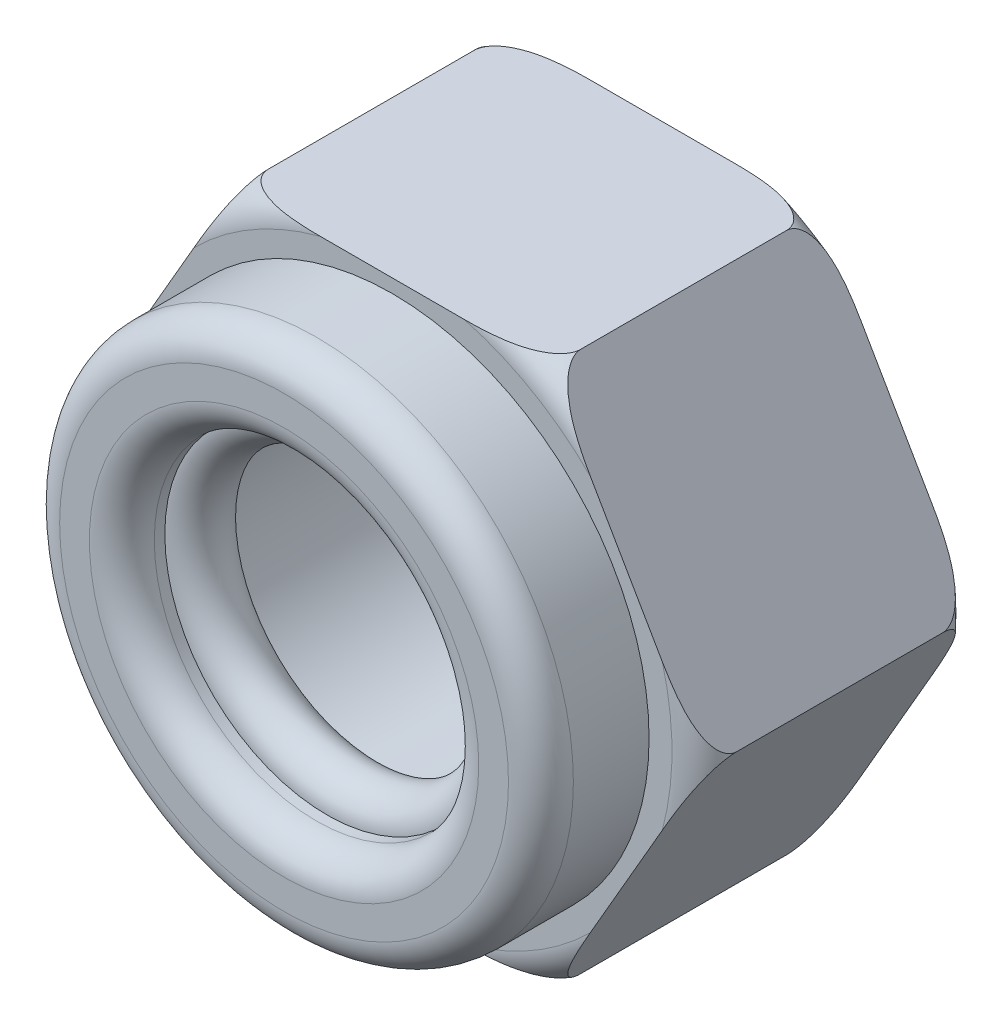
ISO-10303-21;
HEADER;
FILE_DESCRIPTION(('STEP AP214'),'2;1');
FILE_NAME('part.step','',(''),(''),'','','');
FILE_SCHEMA(('AUTOMOTIVE_DESIGN { 1 0 10303 214 1 1 1 1 }'));
ENDSEC;
DATA;
#1=APPLICATION_CONTEXT('core data for automotive mechanical design processes');
#2=APPLICATION_PROTOCOL_DEFINITION('international standard','automotive_design',2000,#1);
#3=PRODUCT_CONTEXT('',#1,'mechanical');
#4=PRODUCT('Part','Part','',(#3));
#5=PRODUCT_RELATED_PRODUCT_CATEGORY('part','',(#4));
#6=PRODUCT_DEFINITION_FORMATION('','',#4);
#7=PRODUCT_DEFINITION_CONTEXT('part definition',#1,'design');
#8=PRODUCT_DEFINITION('design','',#6,#7);
#9=PRODUCT_DEFINITION_SHAPE('','',#8);
#10=(LENGTH_UNIT() NAMED_UNIT(*) SI_UNIT(.MILLI.,.METRE.));
#11=(NAMED_UNIT(*) PLANE_ANGLE_UNIT() SI_UNIT($,.RADIAN.));
#12=(NAMED_UNIT(*) SI_UNIT($,.STERADIAN.) SOLID_ANGLE_UNIT());
#13=UNCERTAINTY_MEASURE_WITH_UNIT(LENGTH_MEASURE(1.E-05),#10,'distance_accuracy_value','');
#14=(GEOMETRIC_REPRESENTATION_CONTEXT(3) GLOBAL_UNCERTAINTY_ASSIGNED_CONTEXT((#13)) GLOBAL_UNIT_ASSIGNED_CONTEXT((#10,
#11,#12)) REPRESENTATION_CONTEXT('',''));
#15=CARTESIAN_POINT('',(0.,0.,0.));
#16=DIRECTION('',(0.,0.,1.));
#17=DIRECTION('',(1.,0.,0.));
#18=AXIS2_PLACEMENT_3D('',#15,#16,#17);
#19=CARTESIAN_POINT('',(0.,0.,2.5));
#20=DIRECTION('',(0.,0.,-1.));
#21=DIRECTION('',(-1.,0.,0.));
#22=AXIS2_PLACEMENT_3D('',#19,#20,#21);
#23=CYLINDRICAL_SURFACE('',#22,1.5);
#24=CARTESIAN_POINT('',(0.,0.,0.));
#25=DIRECTION('',(0.,0.,1.));
#26=DIRECTION('',(1.,0.,0.));
#27=AXIS2_PLACEMENT_3D('',#24,#25,#26);
#28=CIRCLE('',#27,1.5);
#29=CARTESIAN_POINT('',(1.5,0.,0.));
#30=VERTEX_POINT('',#29);
#31=EDGE_CURVE('E345',#30,#30,#28,.T.);
#32=ORIENTED_EDGE('',*,*,#31,.F.);
#33=EDGE_LOOP('',(#32));
#34=FACE_BOUND('',#33,.T.);
#35=CARTESIAN_POINT('',(0.,0.,2.56066488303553));
#36=DIRECTION('',(0.,0.,1.));
#37=DIRECTION('',(1.,0.,0.));
#38=AXIS2_PLACEMENT_3D('',#35,#36,#37);
#39=CIRCLE('',#38,1.5);
#40=CARTESIAN_POINT('',(1.5,0.,2.56066488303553));
#41=VERTEX_POINT('',#40);
#42=EDGE_CURVE('E39',#41,#41,#39,.T.);
#43=ORIENTED_EDGE('',*,*,#42,.T.);
#44=EDGE_LOOP('',(#43));
#45=FACE_BOUND('',#44,.T.);
#46=ADVANCED_FACE('F35',(#34,#45),#23,.F.);
#47=CARTESIAN_POINT('',(0.,0.,3.2));
#48=DIRECTION('',(0.,0.,1.));
#49=DIRECTION('',(1.,0.,0.));
#50=AXIS2_PLACEMENT_3D('',#47,#48,#49);
#51=CIRCLE('',#50,1.5);
#52=CARTESIAN_POINT('',(1.5,0.,3.2));
#53=VERTEX_POINT('',#52);
#54=EDGE_CURVE('E204',#53,#53,#51,.T.);
#55=ORIENTED_EDGE('',*,*,#54,.T.);
#56=EDGE_LOOP('',(#55));
#57=FACE_BOUND('',#56,.T.);
#58=CARTESIAN_POINT('',(0.,0.,3.10267328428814));
#59=DIRECTION('',(0.,0.,-1.));
#60=DIRECTION('',(-1.,0.,0.));
#61=AXIS2_PLACEMENT_3D('',#58,#59,#60);
#62=CIRCLE('',#61,1.5);
#63=CARTESIAN_POINT('',(-1.5,0.,3.10267328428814));
#64=VERTEX_POINT('',#63);
#65=EDGE_CURVE('E456',#64,#64,#62,.T.);
#66=ORIENTED_EDGE('',*,*,#65,.T.);
#67=EDGE_LOOP('',(#66));
#68=FACE_BOUND('',#67,.T.);
#69=ADVANCED_FACE('F388',(#57,#68),#23,.F.);
#70=CARTESIAN_POINT('',(1.44337567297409,-2.49999999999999,2.5));
#71=DIRECTION('',(-0.866025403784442,0.499999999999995,0.));
#72=DIRECTION('',(-0.499999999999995,-0.866025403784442,0.));
#73=AXIS2_PLACEMENT_3D('',#70,#71,#72);
#74=PLANE('',#73);
#75=CARTESIAN_POINT('',(2.88675127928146,-1.15470070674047E-07,0.300199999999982));
#76=CARTESIAN_POINT('',(2.88676805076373,2.893358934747E-05,0.291196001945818));
#77=CARTESIAN_POINT('',(2.88635856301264,-0.000680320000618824,0.282214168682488));
#78=CARTESIAN_POINT('',(2.88478052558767,-0.00341356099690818,0.264597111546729));
#79=CARTESIAN_POINT('',(2.88361851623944,-0.00542622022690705,0.255959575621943));
#80=CARTESIAN_POINT('',(2.88063054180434,-0.0106015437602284,0.239195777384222));
#81=CARTESIAN_POINT('',(2.87880652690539,-0.0137608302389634,0.231068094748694));
#82=CARTESIAN_POINT('',(2.87461164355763,-0.0210265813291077,0.21538695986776));
#83=CARTESIAN_POINT('',(2.87223959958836,-0.0251350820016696,0.207834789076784));
#84=CARTESIAN_POINT('',(2.8653046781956,-0.037146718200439,0.188440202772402));
#85=CARTESIAN_POINT('',(2.86034718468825,-0.0457333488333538,0.177162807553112));
#86=CARTESIAN_POINT('',(2.84962439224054,-0.0643057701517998,0.156261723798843));
#87=CARTESIAN_POINT('',(2.84385649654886,-0.0742960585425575,0.146643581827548));
#88=CARTESIAN_POINT('',(2.82728467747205,-0.10299929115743,0.122206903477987));
#89=CARTESIAN_POINT('',(2.81593836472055,-0.122651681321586,0.108873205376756));
#90=CARTESIAN_POINT('',(2.79245614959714,-0.1633240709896,0.0855673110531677));
#91=CARTESIAN_POINT('',(2.780319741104,-0.184344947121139,0.0755972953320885));
#92=CARTESIAN_POINT('',(2.75142208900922,-0.234397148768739,0.0552533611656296));
#93=CARTESIAN_POINT('',(2.73448656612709,-0.263730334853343,0.0458861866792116));
#94=CARTESIAN_POINT('',(2.70023738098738,-0.323051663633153,0.0304113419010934));
#95=CARTESIAN_POINT('',(2.68292302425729,-0.353041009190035,0.024310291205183));
#96=CARTESIAN_POINT('',(2.64795522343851,-0.413607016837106,0.014474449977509));
#97=CARTESIAN_POINT('',(2.63030012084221,-0.444186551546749,0.0107641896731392));
#98=CARTESIAN_POINT('',(2.5949432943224,-0.505426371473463,0.00516326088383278));
#99=CARTESIAN_POINT('',(2.5772416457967,-0.536086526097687,0.00327053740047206));
#100=CARTESIAN_POINT('',(2.52094905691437,-0.633588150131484,-0.000695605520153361));
#101=CARTESIAN_POINT('',(2.48232285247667,-0.700490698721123,-0.000353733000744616));
#102=CARTESIAN_POINT('',(2.40508039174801,-0.83427856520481,0.00250694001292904));
#103=CARTESIAN_POINT('',(2.36646417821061,-0.901163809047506,0.00502776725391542));
#104=CARTESIAN_POINT('',(2.30846487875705,-1.00162154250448,0.0083945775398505));
#105=CARTESIAN_POINT('',(2.28908687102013,-1.03518523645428,0.0094491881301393));
#106=CARTESIAN_POINT('',(2.25032664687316,-1.1023199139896,0.0111891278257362));
#107=CARTESIAN_POINT('',(2.23094443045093,-1.1358908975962,0.0118744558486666));
#108=CARTESIAN_POINT('',(2.19219398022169,-1.20300864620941,0.0127254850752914));
#109=CARTESIAN_POINT('',(2.17282574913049,-1.23655540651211,0.012891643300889));
#110=CARTESIAN_POINT('',(2.13408995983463,-1.30364776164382,0.0126768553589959));
#111=CARTESIAN_POINT('',(2.11472240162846,-1.33719335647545,0.0122959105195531));
#112=CARTESIAN_POINT('',(2.05713092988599,-1.43694471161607,0.0104404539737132));
#113=CARTESIAN_POINT('',(2.01891410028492,-1.50313820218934,0.00826220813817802));
#114=CARTESIAN_POINT('',(1.94248398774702,-1.63551904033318,0.00374030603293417));
#115=CARTESIAN_POINT('',(1.90427070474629,-1.70170638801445,0.00139666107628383));
#116=CARTESIAN_POINT('',(1.84705577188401,-1.80080555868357,-3.72964497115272E-05));
#117=CARTESIAN_POINT('',(1.82806370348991,-1.83370078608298,-0.000171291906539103));
#118=CARTESIAN_POINT('',(1.79007766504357,-1.8994945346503,0.000705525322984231));
#119=CARTESIAN_POINT('',(1.77108369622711,-1.93239305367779,0.00171669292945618));
#120=CARTESIAN_POINT('',(1.73318971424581,-1.99802735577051,0.00541722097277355));
#121=CARTESIAN_POINT('',(1.71428958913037,-2.03076333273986,0.00810162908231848));
#122=CARTESIAN_POINT('',(1.67661241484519,-2.09602211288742,0.0158144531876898));
#123=CARTESIAN_POINT('',(1.65783527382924,-2.12854507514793,0.0208408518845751));
#124=CARTESIAN_POINT('',(1.63322384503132,-2.17117332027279,0.0296313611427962));
#125=CARTESIAN_POINT('',(1.627258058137,-2.18150636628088,0.0319353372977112));
#126=CARTESIAN_POINT('',(1.61536264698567,-2.2021098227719,0.0369213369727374));
#127=CARTESIAN_POINT('',(1.60943304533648,-2.21238019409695,0.0396035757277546));
#128=CARTESIAN_POINT('',(1.59167235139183,-2.24314261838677,0.0483042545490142));
#129=CARTESIAN_POINT('',(1.57991616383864,-2.26350493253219,0.0549606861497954));
#130=CARTESIAN_POINT('',(1.55286505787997,-2.31035882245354,0.0729724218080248));
#131=CARTESIAN_POINT('',(1.53770472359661,-2.33661729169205,0.0851548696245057));
#132=CARTESIAN_POINT('',(1.50871451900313,-2.38682979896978,0.114762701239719));
#133=CARTESIAN_POINT('',(1.4948751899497,-2.41080022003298,0.132146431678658));
#134=CARTESIAN_POINT('',(1.47826298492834,-2.43957340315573,0.160534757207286));
#135=CARTESIAN_POINT('',(1.47413921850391,-2.44671597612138,0.168352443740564));
#136=CARTESIAN_POINT('',(1.46641640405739,-2.46009228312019,0.184989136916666));
#137=CARTESIAN_POINT('',(1.46281762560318,-2.46632555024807,0.193808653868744));
#138=CARTESIAN_POINT('',(1.45629957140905,-2.47761515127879,0.212592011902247));
#139=CARTESIAN_POINT('',(1.45338982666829,-2.48265497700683,0.222569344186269));
#140=CARTESIAN_POINT('',(1.44857459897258,-2.49099519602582,0.243439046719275));
#141=CARTESIAN_POINT('',(1.44666522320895,-2.49430233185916,0.254327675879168));
#142=CARTESIAN_POINT('',(1.44470994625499,-2.4976889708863,0.271168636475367));
#143=CARTESIAN_POINT('',(1.44420939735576,-2.49855594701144,0.276917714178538));
#144=CARTESIAN_POINT('',(1.44353911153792,-2.49971691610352,0.28850926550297));
#145=CARTESIAN_POINT('',(1.44337035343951,-2.50000921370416,0.294351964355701));
#146=CARTESIAN_POINT('',(1.44337573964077,-2.49999988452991,0.3002));
#147=B_SPLINE_CURVE_WITH_KNOTS('',3,(#75,#76,#77,#78,#79,#80,#81,#82,#83,#84,#85,#86,#87,#88,
#89,#90,#91,#92,#93,#94,#95,#96,#97,#98,#99,#100,#101,#102,#103,#104,#105,#106,#107,#108,#109,
#110,#111,#112,#113,#114,#115,#116,#117,#118,#119,#120,#121,#122,#123,#124,#125,#126,#127,#128,
#129,#130,#131,#132,#133,#134,#135,#136,#137,#138,#139,#140,#141,#142,#143,#144,#145,#146),
.UNSPECIFIED.,.F.,.F.,(4,2,2,2,2,2,2,2,2,2,2,2,2,2,2,2,2,2,2,2,2,2,2,2,2,2,2,2,2,2,2,2,2,2,2,4),
(0.,0.0269367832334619,0.0536425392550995,0.0802702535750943,0.10695562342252,0.151743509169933,
0.196678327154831,0.275191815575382,0.353756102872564,0.458927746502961,0.56431174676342,
0.670760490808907,0.77708873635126,1.00871264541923,1.24055223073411,1.35686099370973,
1.47317009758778,1.58937678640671,1.70558319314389,1.93497240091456,2.16434593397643,
2.278288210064,2.39226580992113,2.50590765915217,2.61945180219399,2.65590248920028,
2.69237400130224,2.76560127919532,2.8633718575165,2.96037951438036,2.99439970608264,
3.02843730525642,3.06292132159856,3.0972701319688,3.11474214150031,3.13226561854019),.UNSPECIFIED.);
#148=CARTESIAN_POINT('',(2.88675134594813,0.,0.3));
#149=VERTEX_POINT('',#148);
#150=CARTESIAN_POINT('',(2.49720900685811,-0.674707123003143,0.));
#151=VERTEX_POINT('',#150);
#152=EDGE_CURVE('E298',#149,#151,#147,.T.);
#153=ORIENTED_EDGE('',*,*,#152,.F.);
#154=DIRECTION('',(0.,0.,-1.));
#155=VECTOR('',#154,1.);
#156=CARTESIAN_POINT('',(2.88675134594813,0.,2.5));
#157=LINE('',#156,#155);
#158=CARTESIAN_POINT('',(2.88675134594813,0.,2.2));
#159=VERTEX_POINT('',#158);
#160=EDGE_CURVE('E201',#159,#149,#157,.T.);
#161=ORIENTED_EDGE('',*,*,#160,.F.);
#162=CARTESIAN_POINT('',(1.44337573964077,-2.49999988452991,2.1998));
#163=CARTESIAN_POINT('',(1.4433589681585,-2.50002893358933,2.20880399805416));
#164=CARTESIAN_POINT('',(1.44376845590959,-2.49931967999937,2.21778583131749));
#165=CARTESIAN_POINT('',(1.44534649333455,-2.49658643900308,2.23540288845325));
#166=CARTESIAN_POINT('',(1.44650850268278,-2.49457377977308,2.24404042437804));
#167=CARTESIAN_POINT('',(1.44949647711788,-2.48939845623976,2.26080422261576));
#168=CARTESIAN_POINT('',(1.45132049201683,-2.48623916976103,2.26893190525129));
#169=CARTESIAN_POINT('',(1.45551537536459,-2.47897341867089,2.28461304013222));
#170=CARTESIAN_POINT('',(1.45788741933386,-2.47486491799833,2.2921652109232));
#171=CARTESIAN_POINT('',(1.46482234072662,-2.46285328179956,2.31155979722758));
#172=CARTESIAN_POINT('',(1.46977983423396,-2.45426665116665,2.32283719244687));
#173=CARTESIAN_POINT('',(1.48050262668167,-2.43569422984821,2.34373827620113));
#174=CARTESIAN_POINT('',(1.48627052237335,-2.42570394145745,2.35335641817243));
#175=CARTESIAN_POINT('',(1.50284234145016,-2.39700070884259,2.37779309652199));
#176=CARTESIAN_POINT('',(1.51418865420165,-2.37734831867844,2.39112679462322));
#177=CARTESIAN_POINT('',(1.53767086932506,-2.33667592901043,2.41443268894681));
#178=CARTESIAN_POINT('',(1.5498072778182,-2.3156550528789,2.42440270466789));
#179=CARTESIAN_POINT('',(1.57870492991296,-2.26560285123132,2.44474663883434));
#180=CARTESIAN_POINT('',(1.59564045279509,-2.23626966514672,2.45411381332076));
#181=CARTESIAN_POINT('',(1.62988963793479,-2.17694833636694,2.46958865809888));
#182=CARTESIAN_POINT('',(1.64720399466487,-2.14695899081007,2.47568970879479));
#183=CARTESIAN_POINT('',(1.68217179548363,-2.08639298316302,2.48552555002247));
#184=CARTESIAN_POINT('',(1.69982689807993,-2.05581344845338,2.48923581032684));
#185=CARTESIAN_POINT('',(1.73518372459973,-1.99457362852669,2.49483673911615));
#186=CARTESIAN_POINT('',(1.75288537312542,-1.96391347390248,2.49672946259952));
#187=CARTESIAN_POINT('',(1.80917796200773,-1.86641184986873,2.50069560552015));
#188=CARTESIAN_POINT('',(1.84780416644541,-1.79950930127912,2.50035373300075));
#189=CARTESIAN_POINT('',(1.92504662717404,-1.66572143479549,2.49749305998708));
#190=CARTESIAN_POINT('',(1.96366284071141,-1.59883619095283,2.4949722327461));
#191=CARTESIAN_POINT('',(2.02166214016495,-1.4983784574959,2.49160542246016));
#192=CARTESIAN_POINT('',(2.04104014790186,-1.46481476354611,2.49055081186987));
#193=CARTESIAN_POINT('',(2.07980037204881,-1.39768008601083,2.48881087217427));
#194=CARTESIAN_POINT('',(2.09918258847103,-1.36410910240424,2.48812554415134));
#195=CARTESIAN_POINT('',(2.13793303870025,-1.29699135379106,2.48727451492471));
#196=CARTESIAN_POINT('',(2.15730126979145,-1.26344459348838,2.48710835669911));
#197=CARTESIAN_POINT('',(2.19603705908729,-1.1963522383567,2.487323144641));
#198=CARTESIAN_POINT('',(2.21540461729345,-1.16280664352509,2.48770408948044));
#199=CARTESIAN_POINT('',(2.27299608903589,-1.06305528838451,2.48955954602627));
#200=CARTESIAN_POINT('',(2.31121291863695,-0.996861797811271,2.4917377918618));
#201=CARTESIAN_POINT('',(2.38764303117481,-0.864480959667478,2.49625969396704));
#202=CARTESIAN_POINT('',(2.42585631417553,-0.798293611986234,2.4986033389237));
#203=CARTESIAN_POINT('',(2.48307124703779,-0.699194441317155,2.50003729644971));
#204=CARTESIAN_POINT('',(2.50206331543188,-0.666299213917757,2.50017129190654));
#205=CARTESIAN_POINT('',(2.5400493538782,-0.600505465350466,2.49929447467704));
#206=CARTESIAN_POINT('',(2.55904332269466,-0.567606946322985,2.49828330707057));
#207=CARTESIAN_POINT('',(2.59693730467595,-0.501972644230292,2.49458277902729));
#208=CARTESIAN_POINT('',(2.61583742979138,-0.469236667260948,2.49189837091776));
#209=CARTESIAN_POINT('',(2.65351460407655,-0.403977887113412,2.48418554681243));
#210=CARTESIAN_POINT('',(2.6722917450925,-0.371454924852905,2.47915914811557));
#211=CARTESIAN_POINT('',(2.69690317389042,-0.328826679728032,2.47036863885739));
#212=CARTESIAN_POINT('',(2.70286896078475,-0.318493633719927,2.46806466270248));
#213=CARTESIAN_POINT('',(2.7147643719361,-0.297890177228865,2.46307866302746));
#214=CARTESIAN_POINT('',(2.72069397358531,-0.287619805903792,2.46039642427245));
#215=CARTESIAN_POINT('',(2.73845466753,-0.256857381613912,2.4516957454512));
#216=CARTESIAN_POINT('',(2.75021085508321,-0.236495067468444,2.44503931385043));
#217=CARTESIAN_POINT('',(2.77726196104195,-0.18964117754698,2.42702757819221));
#218=CARTESIAN_POINT('',(2.79242229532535,-0.163382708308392,2.41484513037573));
#219=CARTESIAN_POINT('',(2.82141249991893,-0.113170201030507,2.38523729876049));
#220=CARTESIAN_POINT('',(2.8352518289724,-0.0891997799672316,2.36785356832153));
#221=CARTESIAN_POINT('',(2.85186403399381,-0.0604265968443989,2.33946524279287));
#222=CARTESIAN_POINT('',(2.85598780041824,-0.053284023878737,2.33164755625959));
#223=CARTESIAN_POINT('',(2.86371061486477,-0.039907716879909,2.31501086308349));
#224=CARTESIAN_POINT('',(2.86730939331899,-0.0336744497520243,2.30619134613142));
#225=CARTESIAN_POINT('',(2.87382744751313,-0.0223848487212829,2.28740798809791));
#226=CARTESIAN_POINT('',(2.87673719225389,-0.017345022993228,2.27743065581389));
#227=CARTESIAN_POINT('',(2.88155241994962,-0.00900480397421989,2.25656095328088));
#228=CARTESIAN_POINT('',(2.88346179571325,-0.00569766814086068,2.24567232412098));
#229=CARTESIAN_POINT('',(2.88541707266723,-0.00231102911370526,2.22883136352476));
#230=CARTESIAN_POINT('',(2.88591762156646,-0.00144405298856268,2.22308228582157));
#231=CARTESIAN_POINT('',(2.8865879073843,-0.000283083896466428,2.21149073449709));
#232=CARTESIAN_POINT('',(2.88675666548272,9.21370417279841E-06,2.20564803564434));
#233=CARTESIAN_POINT('',(2.88675127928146,-1.1547007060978E-07,2.19980000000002));
#234=B_SPLINE_CURVE_WITH_KNOTS('',3,(#162,#163,#164,#165,#166,#167,#168,#169,#170,#171,#172,
#173,#174,#175,#176,#177,#178,#179,#180,#181,#182,#183,#184,#185,#186,#187,#188,#189,#190,#191,
#192,#193,#194,#195,#196,#197,#198,#199,#200,#201,#202,#203,#204,#205,#206,#207,#208,#209,#210,
#211,#212,#213,#214,#215,#216,#217,#218,#219,#220,#221,#222,#223,#224,#225,#226,#227,#228,#229,
#230,#231,#232,#233),.UNSPECIFIED.,.F.,.F.,(4,2,2,2,2,2,2,2,2,2,2,2,2,2,2,2,2,2,2,2,2,2,2,2,2,2,
2,2,2,2,2,2,2,2,2,4),(0.,0.0269367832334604,0.0536425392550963,0.0802702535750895,
0.106955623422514,0.15174350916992,0.196678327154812,0.275191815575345,0.35375610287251,
0.458927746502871,0.564311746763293,0.670760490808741,0.777088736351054,1.00871264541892,
1.2405522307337,1.35686099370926,1.47317009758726,1.58937678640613,1.70558319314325,
1.93497240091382,2.16434593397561,2.27828821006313,2.39226580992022,2.50590765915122,
2.619451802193,2.65590248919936,2.69237400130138,2.7656012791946,2.86337185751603,
2.96037951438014,2.99439970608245,3.02843730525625,3.0629213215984,3.09727013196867,
3.11474214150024,3.13226561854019),.UNSPECIFIED.);
#235=CARTESIAN_POINT('',(2.49720900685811,-0.674707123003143,2.5));
#236=VERTEX_POINT('',#235);
#237=EDGE_CURVE('E370',#236,#159,#234,.T.);
#238=ORIENTED_EDGE('',*,*,#237,.F.);
#239=DIRECTION('',(0.499999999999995,0.866025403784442,0.));
#240=VECTOR('',#239,1.);
#241=CARTESIAN_POINT('',(1.44337567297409,-2.49999999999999,2.5));
#242=LINE('',#241,#240);
#243=CARTESIAN_POINT('',(1.83291801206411,-1.82529287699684,2.5));
#244=VERTEX_POINT('',#243);
#245=EDGE_CURVE('E356',#244,#236,#242,.T.);
#246=ORIENTED_EDGE('',*,*,#245,.F.);
#247=CARTESIAN_POINT('',(1.44337567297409,-2.49999999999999,2.2));
#248=VERTEX_POINT('',#247);
#249=EDGE_CURVE('E252',#248,#244,#234,.T.);
#250=ORIENTED_EDGE('',*,*,#249,.F.);
#251=DIRECTION('',(0.,0.,-1.));
#252=VECTOR('',#251,1.);
#253=CARTESIAN_POINT('',(1.44337567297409,-2.49999999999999,2.5));
#254=LINE('',#253,#252);
#255=CARTESIAN_POINT('',(1.44337567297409,-2.49999999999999,0.3));
#256=VERTEX_POINT('',#255);
#257=EDGE_CURVE('E195',#248,#256,#254,.T.);
#258=ORIENTED_EDGE('',*,*,#257,.T.);
#259=CARTESIAN_POINT('',(1.83291801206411,-1.82529287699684,0.));
#260=VERTEX_POINT('',#259);
#261=EDGE_CURVE('E304',#260,#256,#147,.T.);
#262=ORIENTED_EDGE('',*,*,#261,.F.);
#263=DIRECTION('',(0.499999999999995,0.866025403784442,0.));
#264=VECTOR('',#263,1.);
#265=CARTESIAN_POINT('',(1.44337567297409,-2.49999999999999,0.));
#266=LINE('',#265,#264);
#267=EDGE_CURVE('E341',#260,#151,#266,.T.);
#268=ORIENTED_EDGE('',*,*,#267,.T.);
#269=EDGE_LOOP('',(#153,#161,#238,#246,#250,#258,#262,#268));
#270=FACE_BOUND('',#269,.T.);
#271=ADVANCED_FACE('F394',(#270),#74,.F.);
#272=CARTESIAN_POINT('',(2.88675134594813,0.,2.5));
#273=DIRECTION('',(-0.866025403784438,-0.500000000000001,0.));
#274=DIRECTION('',(0.500000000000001,-0.866025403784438,0.));
#275=AXIS2_PLACEMENT_3D('',#272,#273,#274);
#276=PLANE('',#275);
#277=CARTESIAN_POINT('',(1.44337573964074,2.49999988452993,0.3002));
#278=CARTESIAN_POINT('',(1.44335896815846,2.50002893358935,0.291196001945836));
#279=CARTESIAN_POINT('',(1.44376845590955,2.49931967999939,0.282214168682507));
#280=CARTESIAN_POINT('',(1.44534649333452,2.4965864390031,0.264597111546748));
#281=CARTESIAN_POINT('',(1.44650850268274,2.4945737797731,0.255959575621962));
#282=CARTESIAN_POINT('',(1.44949647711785,2.48939845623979,0.239195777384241));
#283=CARTESIAN_POINT('',(1.45132049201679,2.48623916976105,0.231068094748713));
#284=CARTESIAN_POINT('',(1.45551537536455,2.47897341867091,0.215386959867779));
#285=CARTESIAN_POINT('',(1.45788741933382,2.47486491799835,0.207834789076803));
#286=CARTESIAN_POINT('',(1.46482234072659,2.46285328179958,0.188440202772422));
#287=CARTESIAN_POINT('',(1.46977983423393,2.45426665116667,0.177162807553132));
#288=CARTESIAN_POINT('',(1.48050262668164,2.43569422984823,0.156261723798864));
#289=CARTESIAN_POINT('',(1.48627052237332,2.42570394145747,0.146643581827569));
#290=CARTESIAN_POINT('',(1.50284234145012,2.39700070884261,0.122206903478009));
#291=CARTESIAN_POINT('',(1.51418865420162,2.37734831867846,0.108873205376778));
#292=CARTESIAN_POINT('',(1.53767086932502,2.33667592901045,0.0855673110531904));
#293=CARTESIAN_POINT('',(1.54980727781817,2.31565505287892,0.0755972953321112));
#294=CARTESIAN_POINT('',(1.57870492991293,2.26560285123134,0.055253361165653));
#295=CARTESIAN_POINT('',(1.59564045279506,2.23626966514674,0.0458861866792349));
#296=CARTESIAN_POINT('',(1.62988963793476,2.17694833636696,0.0304113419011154));
#297=CARTESIAN_POINT('',(1.64720399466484,2.14695899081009,0.0243102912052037));
#298=CARTESIAN_POINT('',(1.6821717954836,2.08639298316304,0.0144744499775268));
#299=CARTESIAN_POINT('',(1.6998268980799,2.05581344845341,0.0107641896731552));
#300=CARTESIAN_POINT('',(1.7351837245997,1.99457362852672,0.00516326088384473));
#301=CARTESIAN_POINT('',(1.75288537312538,1.96391347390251,0.00327053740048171));
#302=CARTESIAN_POINT('',(1.8091779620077,1.86641184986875,-0.000695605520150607));
#303=CARTESIAN_POINT('',(1.84780416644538,1.79950930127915,-0.000353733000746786));
#304=CARTESIAN_POINT('',(1.925046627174,1.66572143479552,0.00250694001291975));
#305=CARTESIAN_POINT('',(1.96366284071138,1.59883619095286,0.00502776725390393));
#306=CARTESIAN_POINT('',(2.02166214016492,1.49837845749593,0.00839457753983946));
#307=CARTESIAN_POINT('',(2.04104014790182,1.46481476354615,0.00944918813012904));
#308=CARTESIAN_POINT('',(2.07980037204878,1.39768008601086,0.0111891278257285));
#309=CARTESIAN_POINT('',(2.099182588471,1.36410910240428,0.0118744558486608));
#310=CARTESIAN_POINT('',(2.13793303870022,1.2969913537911,0.0127254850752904));
#311=CARTESIAN_POINT('',(2.15730126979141,1.26344459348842,0.0128916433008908));
#312=CARTESIAN_POINT('',(2.19603705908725,1.19635223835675,0.0126768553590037));
#313=CARTESIAN_POINT('',(2.21540461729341,1.16280664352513,0.012295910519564));
#314=CARTESIAN_POINT('',(2.27299608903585,1.06305528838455,0.0104404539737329));
#315=CARTESIAN_POINT('',(2.31121291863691,0.996861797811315,0.00826220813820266));
#316=CARTESIAN_POINT('',(2.38764303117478,0.864480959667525,0.0037403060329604));
#317=CARTESIAN_POINT('',(2.42585631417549,0.798293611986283,0.00139666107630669));
#318=CARTESIAN_POINT('',(2.48307124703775,0.699194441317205,-3.72964497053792E-05));
#319=CARTESIAN_POINT('',(2.50206331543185,0.666299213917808,-0.000171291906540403));
#320=CARTESIAN_POINT('',(2.54004935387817,0.600505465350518,0.000705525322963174));
#321=CARTESIAN_POINT('',(2.55904332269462,0.567606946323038,0.0017166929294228));
#322=CARTESIAN_POINT('',(2.59693730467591,0.501972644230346,0.00541722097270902));
#323=CARTESIAN_POINT('',(2.61583742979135,0.469236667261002,0.00810162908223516));
#324=CARTESIAN_POINT('',(2.65351460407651,0.403977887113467,0.0158144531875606));
#325=CARTESIAN_POINT('',(2.67229174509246,0.37145492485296,0.0208408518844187));
#326=CARTESIAN_POINT('',(2.69690317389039,0.328826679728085,0.0296313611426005));
#327=CARTESIAN_POINT('',(2.70286896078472,0.318493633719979,0.0319353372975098));
#328=CARTESIAN_POINT('',(2.71476437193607,0.297890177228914,0.0369213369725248));
#329=CARTESIAN_POINT('',(2.72069397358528,0.28761980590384,0.0396035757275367));
#330=CARTESIAN_POINT('',(2.73845466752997,0.256857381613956,0.048304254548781));
#331=CARTESIAN_POINT('',(2.75021085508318,0.236495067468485,0.0549606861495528));
#332=CARTESIAN_POINT('',(2.77726196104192,0.189641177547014,0.0729724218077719));
#333=CARTESIAN_POINT('',(2.79242229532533,0.16338270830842,0.085154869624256));
#334=CARTESIAN_POINT('',(2.82141249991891,0.113170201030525,0.114762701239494));
#335=CARTESIAN_POINT('',(2.83525182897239,0.0891997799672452,0.132146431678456));
#336=CARTESIAN_POINT('',(2.8518640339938,0.0604265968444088,0.16053475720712));
#337=CARTESIAN_POINT('',(2.85598780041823,0.0532840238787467,0.168352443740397));
#338=CARTESIAN_POINT('',(2.86371061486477,0.0399077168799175,0.184989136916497));
#339=CARTESIAN_POINT('',(2.86730939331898,0.0336744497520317,0.193808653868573));
#340=CARTESIAN_POINT('',(2.87382744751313,0.0223848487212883,0.212592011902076));
#341=CARTESIAN_POINT('',(2.87673719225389,0.0173450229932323,0.2225693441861));
#342=CARTESIAN_POINT('',(2.88155241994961,0.0090048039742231,0.243439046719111));
#343=CARTESIAN_POINT('',(2.88346179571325,0.00569766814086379,0.254327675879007));
#344=CARTESIAN_POINT('',(2.88541707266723,0.00231102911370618,0.271168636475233));
#345=CARTESIAN_POINT('',(2.88591762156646,0.00144405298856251,0.276917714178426));
#346=CARTESIAN_POINT('',(2.8865879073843,0.000283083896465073,0.288509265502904));
#347=CARTESIAN_POINT('',(2.88675666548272,-9.2137041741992E-06,0.294351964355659));
#348=CARTESIAN_POINT('',(2.88675127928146,1.15470070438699E-07,0.300199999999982));
#349=B_SPLINE_CURVE_WITH_KNOTS('',3,(#277,#278,#279,#280,#281,#282,#283,#284,#285,#286,#287,
#288,#289,#290,#291,#292,#293,#294,#295,#296,#297,#298,#299,#300,#301,#302,#303,#304,#305,#306,
#307,#308,#309,#310,#311,#312,#313,#314,#315,#316,#317,#318,#319,#320,#321,#322,#323,#324,#325,
#326,#327,#328,#329,#330,#331,#332,#333,#334,#335,#336,#337,#338,#339,#340,#341,#342,#343,#344,
#345,#346,#347,#348),.UNSPECIFIED.,.F.,.F.,(4,2,2,2,2,2,2,2,2,2,2,2,2,2,2,2,2,2,2,2,2,2,2,2,2,2,
2,2,2,2,2,2,2,2,2,4),(0.,0.0269367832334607,0.053642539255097,0.080270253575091,
0.106955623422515,0.151743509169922,0.196678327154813,0.275191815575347,0.353756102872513,
0.458927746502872,0.564311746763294,0.67076049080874,0.777088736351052,1.00871264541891,
1.24055223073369,1.35686099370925,1.47317009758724,1.58937678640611,1.70558319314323,
1.9349724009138,2.16434593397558,2.2782882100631,2.3922658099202,2.50590765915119,
2.61945180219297,2.65590248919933,2.69237400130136,2.76560127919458,2.86337185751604,
2.96037951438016,2.99439970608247,3.02843730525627,3.06292132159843,3.09727013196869,
3.11474214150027,3.13226561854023),.UNSPECIFIED.);
#350=CARTESIAN_POINT('',(1.44337567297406,2.50000000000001,0.3));
#351=VERTEX_POINT('',#350);
#352=CARTESIAN_POINT('',(1.83291801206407,1.82529287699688,0.));
#353=VERTEX_POINT('',#352);
#354=EDGE_CURVE('E53',#351,#353,#349,.T.);
#355=ORIENTED_EDGE('',*,*,#354,.F.);
#356=DIRECTION('',(0.,0.,-1.));
#357=VECTOR('',#356,1.);
#358=CARTESIAN_POINT('',(1.44337567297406,2.50000000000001,2.5));
#359=LINE('',#358,#357);
#360=CARTESIAN_POINT('',(1.44337567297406,2.50000000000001,2.2));
#361=VERTEX_POINT('',#360);
#362=EDGE_CURVE('E192',#361,#351,#359,.T.);
#363=ORIENTED_EDGE('',*,*,#362,.F.);
#364=CARTESIAN_POINT('',(2.88675127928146,1.15470070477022E-07,2.19980000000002));
#365=CARTESIAN_POINT('',(2.88676805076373,-2.89335893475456E-05,2.20880399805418));
#366=CARTESIAN_POINT('',(2.88635856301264,0.00068032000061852,2.21778583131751));
#367=CARTESIAN_POINT('',(2.88478052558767,0.00341356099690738,2.23540288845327));
#368=CARTESIAN_POINT('',(2.88361851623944,0.00542622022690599,2.24404042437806));
#369=CARTESIAN_POINT('',(2.88063054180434,0.0106015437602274,2.26080422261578));
#370=CARTESIAN_POINT('',(2.87880652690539,0.0137608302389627,2.26893190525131));
#371=CARTESIAN_POINT('',(2.87461164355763,0.021026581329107,2.28461304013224));
#372=CARTESIAN_POINT('',(2.87223959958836,0.0251350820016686,2.29216521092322));
#373=CARTESIAN_POINT('',(2.8653046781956,0.0371467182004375,2.3115597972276));
#374=CARTESIAN_POINT('',(2.86034718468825,0.0457333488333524,2.32283719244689));
#375=CARTESIAN_POINT('',(2.84962439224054,0.0643057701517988,2.34373827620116));
#376=CARTESIAN_POINT('',(2.84385649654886,0.0742960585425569,2.35335641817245));
#377=CARTESIAN_POINT('',(2.82728467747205,0.10299929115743,2.37779309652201));
#378=CARTESIAN_POINT('',(2.81593836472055,0.122651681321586,2.39112679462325));
#379=CARTESIAN_POINT('',(2.79245614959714,0.163324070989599,2.41443268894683));
#380=CARTESIAN_POINT('',(2.78031974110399,0.184344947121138,2.42440270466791));
#381=CARTESIAN_POINT('',(2.75142208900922,0.234397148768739,2.44474663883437));
#382=CARTESIAN_POINT('',(2.73448656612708,0.263730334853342,2.45411381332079));
#383=CARTESIAN_POINT('',(2.70023738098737,0.323051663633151,2.46958865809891));
#384=CARTESIAN_POINT('',(2.68292302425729,0.353041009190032,2.47568970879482));
#385=CARTESIAN_POINT('',(2.64795522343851,0.413607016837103,2.48552555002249));
#386=CARTESIAN_POINT('',(2.63030012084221,0.444186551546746,2.48923581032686));
#387=CARTESIAN_POINT('',(2.59494329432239,0.505426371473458,2.49483673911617));
#388=CARTESIAN_POINT('',(2.5772416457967,0.536086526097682,2.49672946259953));
#389=CARTESIAN_POINT('',(2.52094905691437,0.633588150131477,2.50069560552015));
#390=CARTESIAN_POINT('',(2.48232285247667,0.700490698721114,2.50035373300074));
#391=CARTESIAN_POINT('',(2.405080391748,0.834278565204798,2.49749305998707));
#392=CARTESIAN_POINT('',(2.36646417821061,0.901163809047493,2.49497223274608));
#393=CARTESIAN_POINT('',(2.30846487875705,1.00162154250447,2.49160542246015));
#394=CARTESIAN_POINT('',(2.28908687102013,1.03518523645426,2.49055081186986));
#395=CARTESIAN_POINT('',(2.25032664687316,1.10231991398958,2.48881087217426));
#396=CARTESIAN_POINT('',(2.23094443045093,1.13589089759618,2.48812554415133));
#397=CARTESIAN_POINT('',(2.19219398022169,1.20300864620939,2.48727451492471));
#398=CARTESIAN_POINT('',(2.17282574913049,1.23655540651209,2.48710835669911));
#399=CARTESIAN_POINT('',(2.13408995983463,1.30364776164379,2.487323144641));
#400=CARTESIAN_POINT('',(2.11472240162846,1.33719335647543,2.48770408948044));
#401=CARTESIAN_POINT('',(2.05713092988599,1.43694471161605,2.48955954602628));
#402=CARTESIAN_POINT('',(2.01891410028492,1.50313820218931,2.49173779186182));
#403=CARTESIAN_POINT('',(1.94248398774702,1.63551904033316,2.49625969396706));
#404=CARTESIAN_POINT('',(1.90427070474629,1.70170638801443,2.49860333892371));
#405=CARTESIAN_POINT('',(1.84705577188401,1.80080555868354,2.50003729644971));
#406=CARTESIAN_POINT('',(1.82806370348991,1.83370078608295,2.50017129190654));
#407=CARTESIAN_POINT('',(1.79007766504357,1.89949453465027,2.49929447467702));
#408=CARTESIAN_POINT('',(1.77108369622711,1.93239305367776,2.49828330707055));
#409=CARTESIAN_POINT('',(1.73318971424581,1.99802735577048,2.49458277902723));
#410=CARTESIAN_POINT('',(1.71428958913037,2.03076333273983,2.49189837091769));
#411=CARTESIAN_POINT('',(1.67661241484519,2.09602211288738,2.48418554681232));
#412=CARTESIAN_POINT('',(1.65783527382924,2.1285450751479,2.47915914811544));
#413=CARTESIAN_POINT('',(1.63322384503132,2.17117332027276,2.47036863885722));
#414=CARTESIAN_POINT('',(1.627258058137,2.18150636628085,2.4680646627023));
#415=CARTESIAN_POINT('',(1.61536264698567,2.20210982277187,2.46307866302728));
#416=CARTESIAN_POINT('',(1.60943304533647,2.21238019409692,2.46039642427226));
#417=CARTESIAN_POINT('',(1.59167235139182,2.24314261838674,2.451695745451));
#418=CARTESIAN_POINT('',(1.57991616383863,2.26350493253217,2.44503931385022));
#419=CARTESIAN_POINT('',(1.55286505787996,2.31035882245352,2.42702757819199));
#420=CARTESIAN_POINT('',(1.5377047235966,2.33661729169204,2.41484513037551));
#421=CARTESIAN_POINT('',(1.50871451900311,2.38682979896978,2.3852372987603));
#422=CARTESIAN_POINT('',(1.49487518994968,2.41080022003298,2.36785356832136));
#423=CARTESIAN_POINT('',(1.47826298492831,2.43957340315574,2.33946524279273));
#424=CARTESIAN_POINT('',(1.47413921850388,2.44671597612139,2.33164755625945));
#425=CARTESIAN_POINT('',(1.46641640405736,2.4600922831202,2.31501086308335));
#426=CARTESIAN_POINT('',(1.46281762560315,2.46632555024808,2.30619134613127));
#427=CARTESIAN_POINT('',(1.45629957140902,2.4776151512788,2.28740798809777));
#428=CARTESIAN_POINT('',(1.45338982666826,2.48265497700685,2.27743065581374));
#429=CARTESIAN_POINT('',(1.44857459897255,2.49099519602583,2.25656095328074));
#430=CARTESIAN_POINT('',(1.44666522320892,2.49430233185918,2.24567232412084));
#431=CARTESIAN_POINT('',(1.44470994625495,2.49768897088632,2.22883136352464));
#432=CARTESIAN_POINT('',(1.44420939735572,2.49855594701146,2.22308228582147));
#433=CARTESIAN_POINT('',(1.44353911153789,2.49971691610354,2.21149073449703));
#434=CARTESIAN_POINT('',(1.44337035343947,2.50000921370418,2.2056480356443));
#435=CARTESIAN_POINT('',(1.44337573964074,2.49999988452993,2.1998));
#436=B_SPLINE_CURVE_WITH_KNOTS('',3,(#364,#365,#366,#367,#368,#369,#370,#371,#372,#373,#374,
#375,#376,#377,#378,#379,#380,#381,#382,#383,#384,#385,#386,#387,#388,#389,#390,#391,#392,#393,
#394,#395,#396,#397,#398,#399,#400,#401,#402,#403,#404,#405,#406,#407,#408,#409,#410,#411,#412,
#413,#414,#415,#416,#417,#418,#419,#420,#421,#422,#423,#424,#425,#426,#427,#428,#429,#430,#431,
#432,#433,#434,#435),.UNSPECIFIED.,.F.,.F.,(4,2,2,2,2,2,2,2,2,2,2,2,2,2,2,2,2,2,2,2,2,2,2,2,2,2,
2,2,2,2,2,2,2,2,2,4),(0.,0.026936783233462,0.0536425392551,0.0802702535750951,0.106955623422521,
0.151743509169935,0.196678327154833,0.275191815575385,0.353756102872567,0.458927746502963,
0.564311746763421,0.670760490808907,0.777088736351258,1.00871264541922,1.2405522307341,
1.35686099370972,1.47317009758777,1.58937678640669,1.70558319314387,1.93497240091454,
2.16434593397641,2.27828821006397,2.39226580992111,2.50590765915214,2.61945180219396,
2.65590248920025,2.69237400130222,2.76560127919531,2.86337185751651,2.96037951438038,
2.99439970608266,3.02843730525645,3.06292132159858,3.09727013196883,3.11474214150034,
3.13226561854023),.UNSPECIFIED.);
#437=CARTESIAN_POINT('',(1.83291801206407,1.82529287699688,2.5));
#438=VERTEX_POINT('',#437);
#439=EDGE_CURVE('E270',#438,#361,#436,.T.);
#440=ORIENTED_EDGE('',*,*,#439,.F.);
#441=DIRECTION('',(-0.500000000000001,0.866025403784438,0.));
#442=VECTOR('',#441,1.);
#443=CARTESIAN_POINT('',(2.88675134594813,0.,2.5));
#444=LINE('',#443,#442);
#445=CARTESIAN_POINT('',(2.49720900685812,0.674707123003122,2.5));
#446=VERTEX_POINT('',#445);
#447=EDGE_CURVE('E358',#446,#438,#444,.T.);
#448=ORIENTED_EDGE('',*,*,#447,.F.);
#449=EDGE_CURVE('E372',#159,#446,#436,.T.);
#450=ORIENTED_EDGE('',*,*,#449,.F.);
#451=ORIENTED_EDGE('',*,*,#160,.T.);
#452=CARTESIAN_POINT('',(2.49720900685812,0.674707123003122,0.));
#453=VERTEX_POINT('',#452);
#454=EDGE_CURVE('E295',#453,#149,#349,.T.);
#455=ORIENTED_EDGE('',*,*,#454,.F.);
#456=DIRECTION('',(-0.500000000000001,0.866025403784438,0.));
#457=VECTOR('',#456,1.);
#458=CARTESIAN_POINT('',(2.88675134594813,0.,0.));
#459=LINE('',#458,#457);
#460=EDGE_CURVE('E344',#453,#353,#459,.T.);
#461=ORIENTED_EDGE('',*,*,#460,.T.);
#462=EDGE_LOOP('',(#355,#363,#440,#448,#450,#451,#455,#461));
#463=FACE_BOUND('',#462,.T.);
#464=ADVANCED_FACE('F279',(#463),#276,.F.);
#465=CARTESIAN_POINT('',(1.44337567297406,2.50000000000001,2.5));
#466=DIRECTION('',(0.,-1.,0.));
#467=DIRECTION('',(1.,0.,0.));
#468=AXIS2_PLACEMENT_3D('',#465,#466,#467);
#469=PLANE('',#468);
#470=CARTESIAN_POINT('',(0.,2.49999999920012,0.0128167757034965));
#471=CARTESIAN_POINT('',(0.0498564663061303,2.49999999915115,0.0128159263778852));
#472=CARTESIAN_POINT('',(0.0997130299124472,2.4999999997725,0.012352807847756));
#473=CARTESIAN_POINT('',(0.199415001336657,2.50000000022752,0.0106558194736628));
#474=CARTESIAN_POINT('',(0.249260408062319,2.50000000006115,0.00942189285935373));
#475=CARTESIAN_POINT('',(0.349260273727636,2.49999999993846,0.00661824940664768));
#476=CARTESIAN_POINT('',(0.399414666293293,2.49999999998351,0.00504643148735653));
#477=CARTESIAN_POINT('',(0.499708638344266,2.50000000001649,0.0022526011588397));
#478=CARTESIAN_POINT('',(0.549848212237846,2.50000000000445,0.00103040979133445));
#479=CARTESIAN_POINT('',(0.650936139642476,2.49999999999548,-0.000211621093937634));
#480=CARTESIAN_POINT('',(0.70188487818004,2.49999999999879,-0.000212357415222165));
#481=CARTESIAN_POINT('',(0.803710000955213,2.50000000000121,0.00215644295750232));
#482=CARTESIAN_POINT('',(0.854586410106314,2.50000000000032,0.00452458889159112));
#483=CARTESIAN_POINT('',(0.955516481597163,2.49999999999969,0.0130265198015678));
#484=CARTESIAN_POINT('',(1.00557297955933,2.49999999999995,0.0191178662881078));
#485=CARTESIAN_POINT('',(1.07980290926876,2.50000000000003,0.0325856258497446));
#486=CARTESIAN_POINT('',(1.10436613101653,2.50000000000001,0.0377852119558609));
#487=CARTESIAN_POINT('',(1.15303013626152,2.5,0.0499982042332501));
#488=CARTESIAN_POINT('',(1.17713132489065,2.5,0.0570099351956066));
#489=CARTESIAN_POINT('',(1.21852851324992,2.50000000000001,0.0712616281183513));
#490=CARTESIAN_POINT('',(1.23599846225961,2.5,0.0779914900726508));
#491=CARTESIAN_POINT('',(1.27031336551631,2.5,0.0930262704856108));
#492=CARTESIAN_POINT('',(1.28715669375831,2.5,0.101334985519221));
#493=CARTESIAN_POINT('',(1.31993866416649,2.5,0.119949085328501));
#494=CARTESIAN_POINT('',(1.33586691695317,2.5,0.130273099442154));
#495=CARTESIAN_POINT('',(1.36591264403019,2.5,0.153289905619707));
#496=CARTESIAN_POINT('',(1.38003644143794,2.50000000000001,0.165974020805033));
#497=CARTESIAN_POINT('',(1.39961370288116,2.50000000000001,0.187813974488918));
#498=CARTESIAN_POINT('',(1.40612366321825,2.50000000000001,0.196018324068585));
#499=CARTESIAN_POINT('',(1.41789588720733,2.50000000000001,0.213291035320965));
#500=CARTESIAN_POINT('',(1.42315860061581,2.50000000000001,0.222359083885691));
#501=CARTESIAN_POINT('',(1.4321140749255,2.50000000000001,0.241390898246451));
#502=CARTESIAN_POINT('',(1.4357871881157,2.50000000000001,0.251364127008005));
#503=CARTESIAN_POINT('',(1.44108170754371,2.50000000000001,0.271840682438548));
#504=CARTESIAN_POINT('',(1.44270648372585,2.50000000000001,0.282343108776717));
#505=CARTESIAN_POINT('',(1.44364000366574,2.50000000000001,0.302008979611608));
#506=CARTESIAN_POINT('',(1.4432345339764,2.50000000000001,0.311159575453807));
#507=CARTESIAN_POINT('',(1.44079254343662,2.50000000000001,0.329240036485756));
#508=CARTESIAN_POINT('',(1.43875551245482,2.50000000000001,0.338169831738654));
#509=CARTESIAN_POINT('',(1.43338520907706,2.50000000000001,0.355086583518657));
#510=CARTESIAN_POINT('',(1.43012845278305,2.50000000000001,0.363098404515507));
#511=CARTESIAN_POINT('',(1.42253435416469,2.50000000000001,0.378585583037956));
#512=CARTESIAN_POINT('',(1.41819669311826,2.50000000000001,0.386060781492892));
#513=CARTESIAN_POINT('',(1.40554915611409,2.50000000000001,0.405096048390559));
#514=CARTESIAN_POINT('',(1.39648878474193,2.50000000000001,0.416157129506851));
#515=CARTESIAN_POINT('',(1.3767659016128,2.50000000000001,0.43674384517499));
#516=CARTESIAN_POINT('',(1.36609871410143,2.5,0.446264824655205));
#517=CARTESIAN_POINT('',(1.3357298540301,2.5,0.470228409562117));
#518=CARTESIAN_POINT('',(1.31499880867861,2.5,0.483354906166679));
#519=CARTESIAN_POINT('',(1.2719004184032,2.5,0.506521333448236));
#520=CARTESIAN_POINT('',(1.24952870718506,2.5,0.516552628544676));
#521=CARTESIAN_POINT('',(1.19736090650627,2.5,0.536741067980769));
#522=CARTESIAN_POINT('',(1.16726758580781,2.5,0.546117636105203));
#523=CARTESIAN_POINT('',(1.10630753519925,2.5,0.561965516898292));
#524=CARTESIAN_POINT('',(1.07543944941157,2.5,0.568431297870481));
#525=CARTESIAN_POINT('',(1.01325789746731,2.5,0.579165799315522));
#526=CARTESIAN_POINT('',(0.98194352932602,2.5,0.583429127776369));
#527=CARTESIAN_POINT('',(0.919128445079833,2.5,0.590265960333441));
#528=CARTESIAN_POINT('',(0.88762766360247,2.5,0.592838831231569));
#529=CARTESIAN_POINT('',(0.822341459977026,2.5,0.596839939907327));
#530=CARTESIAN_POINT('',(0.788550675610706,2.5,0.59817529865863));
#531=CARTESIAN_POINT('',(0.720939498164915,2.5,0.599788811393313));
#532=CARTESIAN_POINT('',(0.687119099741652,2.5,0.600066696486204));
#533=CARTESIAN_POINT('',(0.619522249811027,2.5,0.599907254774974));
#534=CARTESIAN_POINT('',(0.585745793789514,2.5,0.599470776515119));
#535=CARTESIAN_POINT('',(0.51821512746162,2.5,0.598176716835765));
#536=CARTESIAN_POINT('',(0.484460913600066,2.5,0.597319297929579));
#537=CARTESIAN_POINT('',(0.386773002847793,2.5,0.594607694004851));
#538=CARTESIAN_POINT('',(0.322845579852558,2.5,0.592547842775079));
#539=CARTESIAN_POINT('',(0.194968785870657,2.5,0.589226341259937));
#540=CARTESIAN_POINT('',(0.131019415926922,2.5,0.587964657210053));
#541=CARTESIAN_POINT('',(0.00291860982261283,2.5,0.586940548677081));
#542=CARTESIAN_POINT('',(-0.061232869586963,2.5,0.58718252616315));
#543=CARTESIAN_POINT('',(-0.189501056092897,2.5,0.58904443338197));
#544=CARTESIAN_POINT('',(-0.253617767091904,2.5,0.590664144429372));
#545=CARTESIAN_POINT('',(-0.381183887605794,2.5,0.594325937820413));
#546=CARTESIAN_POINT('',(-0.444633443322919,2.5,0.596363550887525));
#547=CARTESIAN_POINT('',(-0.571635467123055,2.5,0.599388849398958));
#548=CARTESIAN_POINT('',(-0.635187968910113,2.5,0.600375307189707));
#549=CARTESIAN_POINT('',(-0.761851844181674,2.5,0.599354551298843));
#550=CARTESIAN_POINT('',(-0.824963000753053,2.5,0.597369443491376));
#551=CARTESIAN_POINT('',(-0.919262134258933,2.5,0.590216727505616));
#552=CARTESIAN_POINT('',(-0.950601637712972,2.5,0.587141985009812));
#553=CARTESIAN_POINT('',(-1.01304008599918,2.5,0.579153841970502));
#554=CARTESIAN_POINT('',(-1.0441391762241,2.5,0.574241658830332));
#555=CARTESIAN_POINT('',(-1.08814857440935,2.5,0.565514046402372));
#556=CARTESIAN_POINT('',(-1.10125555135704,2.5,0.562686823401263));
#557=CARTESIAN_POINT('',(-1.127359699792,2.5,0.556532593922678));
#558=CARTESIAN_POINT('',(-1.14035679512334,2.5,0.553205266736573));
#559=CARTESIAN_POINT('',(-1.17919411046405,2.5,0.542358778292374));
#560=CARTESIAN_POINT('',(-1.20481035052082,2.5,0.533988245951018));
#561=CARTESIAN_POINT('',(-1.25523915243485,2.5,0.514193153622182));
#562=CARTESIAN_POINT('',(-1.28003696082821,2.5,0.502730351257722));
#563=CARTESIAN_POINT('',(-1.32736163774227,2.5,0.475813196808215));
#564=CARTESIAN_POINT('',(-1.34990146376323,2.5,0.460383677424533));
#565=CARTESIAN_POINT('',(-1.37837845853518,2.5,0.43498005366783));
#566=CARTESIAN_POINT('',(-1.38624717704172,2.5,0.427181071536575));
#567=CARTESIAN_POINT('',(-1.40092814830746,2.5,0.410624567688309));
#568=CARTESIAN_POINT('',(-1.40774014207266,2.5,0.401866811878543));
#569=CARTESIAN_POINT('',(-1.41999947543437,2.5,0.383273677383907));
#570=CARTESIAN_POINT('',(-1.42542965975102,2.5,0.373426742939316));
#571=CARTESIAN_POINT('',(-1.43433555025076,2.5,0.352882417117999));
#572=CARTESIAN_POINT('',(-1.43781492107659,2.5,0.342186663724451));
#573=CARTESIAN_POINT('',(-1.44219206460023,2.5,0.321317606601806));
#574=CARTESIAN_POINT('',(-1.44330136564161,2.5,0.311189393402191));
#575=CARTESIAN_POINT('',(-1.44344257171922,2.5,0.290919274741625));
#576=CARTESIAN_POINT('',(-1.44247524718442,2.5,0.28077737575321));
#577=CARTESIAN_POINT('',(-1.43889599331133,2.5,0.262469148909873));
#578=CARTESIAN_POINT('',(-1.4365691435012,2.5,0.25424454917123));
#579=CARTESIAN_POINT('',(-1.43071033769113,2.5,0.238241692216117));
#580=CARTESIAN_POINT('',(-1.42717808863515,2.5,0.230463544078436));
#581=CARTESIAN_POINT('',(-1.41718733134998,2.5,0.211863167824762));
#582=CARTESIAN_POINT('',(-1.41013679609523,2.5,0.201359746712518));
#583=CARTESIAN_POINT('',(-1.39446674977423,2.5,0.181596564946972));
#584=CARTESIAN_POINT('',(-1.38584310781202,2.5,0.172340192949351));
#585=CARTESIAN_POINT('',(-1.36178723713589,2.5,0.149591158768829));
#586=CARTESIAN_POINT('',(-1.34546057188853,2.5,0.137052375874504));
#587=CARTESIAN_POINT('',(-1.31117485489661,2.5,0.114499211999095));
#588=CARTESIAN_POINT('',(-1.29321235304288,2.5,0.104490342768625));
#589=CARTESIAN_POINT('',(-1.25661158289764,2.5,0.0866474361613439));
#590=CARTESIAN_POINT('',(-1.2379887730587,2.5,0.0787810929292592));
#591=CARTESIAN_POINT('',(-1.2001395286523,2.5,0.0646372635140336));
#592=CARTESIAN_POINT('',(-1.18091246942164,2.5,0.0583614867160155));
#593=CARTESIAN_POINT('',(-1.14203566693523,2.5,0.0471066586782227));
#594=CARTESIAN_POINT('',(-1.1223849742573,2.5,0.0421309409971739));
#595=CARTESIAN_POINT('',(-1.0828583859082,2.5,0.0332777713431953));
#596=CARTESIAN_POINT('',(-1.06298267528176,2.49999999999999,0.0293994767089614));
#597=CARTESIAN_POINT('',(-1.00032064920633,2.50000000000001,0.018643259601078));
#598=CARTESIAN_POINT('',(-0.957256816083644,2.50000000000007,0.0133886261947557));
#599=CARTESIAN_POINT('',(-0.870867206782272,2.49999999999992,0.00572106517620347));
#600=CARTESIAN_POINT('',(-0.827541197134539,2.49999999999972,0.00331122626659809));
#601=CARTESIAN_POINT('',(-0.740681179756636,2.50000000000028,0.000403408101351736));
#602=CARTESIAN_POINT('',(-0.697146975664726,2.50000000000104,-8.78322268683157E-05));
#603=CARTESIAN_POINT('',(-0.610078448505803,2.49999999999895,0.000112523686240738));
#604=CARTESIAN_POINT('',(-0.566544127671,2.4999999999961,0.000804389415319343));
#605=CARTESIAN_POINT('',(-0.479385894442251,2.50000000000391,0.0027570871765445));
#606=CARTESIAN_POINT('',(-0.435762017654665,2.50000000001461,0.00401928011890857));
#607=CARTESIAN_POINT('',(-0.348515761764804,2.49999999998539,0.0065966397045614));
#608=CARTESIAN_POINT('',(-0.304893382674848,2.49999999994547,0.00791180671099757));
#609=CARTESIAN_POINT('',(-0.217730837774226,2.50000000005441,0.0101886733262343));
#610=CARTESIAN_POINT('',(-0.174190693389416,2.50000000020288,0.0111511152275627));
#611=CARTESIAN_POINT('',(-0.0871003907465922,2.49999999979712,0.012465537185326));
#612=CARTESIAN_POINT('',(-0.0435502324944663,2.49999999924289,0.0128175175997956));
#613=CARTESIAN_POINT('',(0.,2.49999999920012,0.0128167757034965));
#614=B_SPLINE_CURVE_WITH_KNOTS('',3,(#470,#471,#472,#473,#474,#475,#476,#477,#478,#479,#480,
#481,#482,#483,#484,#485,#486,#487,#488,#489,#490,#491,#492,#493,#494,#495,#496,#497,#498,#499,
#500,#501,#502,#503,#504,#505,#506,#507,#508,#509,#510,#511,#512,#513,#514,#515,#516,#517,#518,
#519,#520,#521,#522,#523,#524,#525,#526,#527,#528,#529,#530,#531,#532,#533,#534,#535,#536,#537,
#538,#539,#540,#541,#542,#543,#544,#545,#546,#547,#548,#549,#550,#551,#552,#553,#554,#555,#556,
#557,#558,#559,#560,#561,#562,#563,#564,#565,#566,#567,#568,#569,#570,#571,#572,#573,#574,#575,
#576,#577,#578,#579,#580,#581,#582,#583,#584,#585,#586,#587,#588,#589,#590,#591,#592,#593,#594,
#595,#596,#597,#598,#599,#600,#601,#602,#603,#604,#605,#606,#607,#608,#609,#610,#611,#612,#613),
.UNSPECIFIED.,.T.,.F.,(4,2,2,2,2,2,2,2,2,2,2,2,2,2,2,2,2,2,2,2,2,2,2,2,2,2,2,2,2,2,2,2,2,2,2,2,
2,2,2,2,2,2,2,2,2,2,2,2,2,2,2,2,2,2,2,2,2,2,2,2,2,2,2,2,2,2,2,2,2,2,2,4),(0.,0.149567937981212,
0.299146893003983,0.44968435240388,0.600144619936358,0.752958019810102,0.905681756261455,
1.0566963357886,1.13196936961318,1.207173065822,1.26327977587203,1.31952314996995,
1.37631341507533,1.43289887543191,1.46423249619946,1.49555480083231,1.52725390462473,
1.55890078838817,1.58622920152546,1.6135661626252,1.6394164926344,1.66527445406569,
1.70792116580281,1.75069446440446,1.82389113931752,1.89729022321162,1.99162970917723,
2.08614772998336,2.18089606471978,2.27567986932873,2.37710783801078,2.47856159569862,
2.57989493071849,2.68118917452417,2.87307117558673,3.0649450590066,3.25738091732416,
3.44978623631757,3.64023215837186,3.83090026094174,4.02015698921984,4.11458991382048,
4.20896038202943,4.24917681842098,4.28941915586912,4.37011694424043,4.45186251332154,
4.53310829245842,4.56627409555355,4.59944801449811,4.63301564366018,4.66652000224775,
4.69688186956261,4.72723247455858,4.75277082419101,4.7783153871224,4.81605100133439,
4.85388717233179,4.91529746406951,4.97684041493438,5.03739632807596,5.09801704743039,
5.15879171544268,5.21951958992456,5.34950460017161,5.4796306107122,5.61021326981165,
5.74082567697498,5.87175140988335,6.00267804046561,6.13332753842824,6.26397695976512),.UNSPECIFIED.);
#615=CARTESIAN_POINT('',(0.664290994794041,2.5,0.));
#616=VERTEX_POINT('',#615);
#617=EDGE_CURVE('E288',#616,#351,#614,.T.);
#618=ORIENTED_EDGE('',*,*,#617,.F.);
#619=DIRECTION('',(-1.,0.,0.));
#620=VECTOR('',#619,1.);
#621=CARTESIAN_POINT('',(1.44337567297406,2.50000000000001,0.));
#622=LINE('',#621,#620);
#623=CARTESIAN_POINT('',(-0.664290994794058,2.5,0.));
#624=VERTEX_POINT('',#623);
#625=EDGE_CURVE('E348',#616,#624,#622,.T.);
#626=ORIENTED_EDGE('',*,*,#625,.T.);
#627=CARTESIAN_POINT('',(-1.44337567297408,2.5,0.3));
#628=VERTEX_POINT('',#627);
#629=EDGE_CURVE('E61',#628,#624,#614,.T.);
#630=ORIENTED_EDGE('',*,*,#629,.F.);
#631=DIRECTION('',(0.,0.,-1.));
#632=VECTOR('',#631,1.);
#633=CARTESIAN_POINT('',(-1.44337567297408,2.5,2.5));
#634=LINE('',#633,#632);
#635=CARTESIAN_POINT('',(-1.44337567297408,2.5,2.2));
#636=VERTEX_POINT('',#635);
#637=EDGE_CURVE('E188',#636,#628,#634,.T.);
#638=ORIENTED_EDGE('',*,*,#637,.F.);
#639=CARTESIAN_POINT('',(0.,2.5,2.48718322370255));
#640=CARTESIAN_POINT('',(-0.049856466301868,2.5,2.4871840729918));
#641=CARTESIAN_POINT('',(-0.0997130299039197,2.5,2.48764719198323));
#642=CARTESIAN_POINT('',(-0.199415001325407,2.5,2.48934418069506));
#643=CARTESIAN_POINT('',(-0.249260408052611,2.5,2.4905781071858));
#644=CARTESIAN_POINT('',(-0.349260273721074,2.5,2.49338175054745));
#645=CARTESIAN_POINT('',(-0.399414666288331,2.5,2.49495356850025));
#646=CARTESIAN_POINT('',(-0.499708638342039,2.5,2.49774739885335));
#647=CARTESIAN_POINT('',(-0.549848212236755,2.5,2.49896959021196));
#648=CARTESIAN_POINT('',(-0.650936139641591,2.5,2.50021162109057));
#649=CARTESIAN_POINT('',(-0.701884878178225,2.5,2.50021235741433));
#650=CARTESIAN_POINT('',(-0.803710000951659,2.5,2.49784355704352));
#651=CARTESIAN_POINT('',(-0.854586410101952,2.5,2.49547541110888));
#652=CARTESIAN_POINT('',(-0.955516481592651,2.5,2.48697348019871));
#653=CARTESIAN_POINT('',(-1.00557297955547,2.5,2.48088213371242));
#654=CARTESIAN_POINT('',(-1.07980290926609,2.5,2.46741437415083));
#655=CARTESIAN_POINT('',(-1.1043661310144,2.5,2.46221478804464));
#656=CARTESIAN_POINT('',(-1.15303013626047,2.5,2.45000179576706));
#657=CARTESIAN_POINT('',(-1.17713132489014,2.5,2.44299006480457));
#658=CARTESIAN_POINT('',(-1.21852851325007,2.5,2.4287383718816));
#659=CARTESIAN_POINT('',(-1.23599846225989,2.5,2.42200850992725));
#660=CARTESIAN_POINT('',(-1.27031336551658,2.5,2.40697372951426));
#661=CARTESIAN_POINT('',(-1.28715669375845,2.5,2.39866501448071));
#662=CARTESIAN_POINT('',(-1.31993866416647,2.5,2.38005091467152));
#663=CARTESIAN_POINT('',(-1.3358669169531,2.5,2.3697269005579));
#664=CARTESIAN_POINT('',(-1.36591264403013,2.5,2.34671009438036));
#665=CARTESIAN_POINT('',(-1.38003644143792,2.5,2.33402597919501));
#666=CARTESIAN_POINT('',(-1.39961370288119,2.5,2.31218602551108));
#667=CARTESIAN_POINT('',(-1.40612366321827,2.5,2.3039816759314));
#668=CARTESIAN_POINT('',(-1.41789588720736,2.5,2.28670896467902));
#669=CARTESIAN_POINT('',(-1.42315860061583,2.5,2.2776409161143));
#670=CARTESIAN_POINT('',(-1.43211407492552,2.5,2.25860910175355));
#671=CARTESIAN_POINT('',(-1.43578718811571,2.5,2.248635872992));
#672=CARTESIAN_POINT('',(-1.44108170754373,2.5,2.22815931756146));
#673=CARTESIAN_POINT('',(-1.44270648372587,2.5,2.21765689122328));
#674=CARTESIAN_POINT('',(-1.44364000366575,2.5,2.19799102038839));
#675=CARTESIAN_POINT('',(-1.44323453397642,2.5,2.18884042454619));
#676=CARTESIAN_POINT('',(-1.44079254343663,2.5,2.17075996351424));
#677=CARTESIAN_POINT('',(-1.43875551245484,2.5,2.16183016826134));
#678=CARTESIAN_POINT('',(-1.43338520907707,2.5,2.14491341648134));
#679=CARTESIAN_POINT('',(-1.43012845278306,2.5,2.13690159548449));
#680=CARTESIAN_POINT('',(-1.4225343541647,2.5,2.12141441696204));
#681=CARTESIAN_POINT('',(-1.41819669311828,2.5,2.11393921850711));
#682=CARTESIAN_POINT('',(-1.40554915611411,2.5,2.09490395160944));
#683=CARTESIAN_POINT('',(-1.39648878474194,2.5,2.08384287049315));
#684=CARTESIAN_POINT('',(-1.37676590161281,2.5,2.06325615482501));
#685=CARTESIAN_POINT('',(-1.36609871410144,2.5,2.05373517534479));
#686=CARTESIAN_POINT('',(-1.33572985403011,2.5,2.02977159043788));
#687=CARTESIAN_POINT('',(-1.31499880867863,2.5,2.01664509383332));
#688=CARTESIAN_POINT('',(-1.27190041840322,2.5,1.99347866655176));
#689=CARTESIAN_POINT('',(-1.24952870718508,2.5,1.98344737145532));
#690=CARTESIAN_POINT('',(-1.19736090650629,2.5,1.96325893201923));
#691=CARTESIAN_POINT('',(-1.16726758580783,2.5,1.9538823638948));
#692=CARTESIAN_POINT('',(-1.10630753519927,2.5,1.93803448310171));
#693=CARTESIAN_POINT('',(-1.07543944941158,2.5,1.93156870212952));
#694=CARTESIAN_POINT('',(-1.01325789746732,2.5,1.92083420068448));
#695=CARTESIAN_POINT('',(-0.981943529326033,2.5,1.91657087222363));
#696=CARTESIAN_POINT('',(-0.919128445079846,2.5,1.90973403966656));
#697=CARTESIAN_POINT('',(-0.887627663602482,2.5,1.90716116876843));
#698=CARTESIAN_POINT('',(-0.822341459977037,2.5,1.90316006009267));
#699=CARTESIAN_POINT('',(-0.788550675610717,2.5,1.90182470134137));
#700=CARTESIAN_POINT('',(-0.720939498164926,2.5,1.90021118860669));
#701=CARTESIAN_POINT('',(-0.687119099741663,2.5,1.8999333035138));
#702=CARTESIAN_POINT('',(-0.619522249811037,2.5,1.90009274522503));
#703=CARTESIAN_POINT('',(-0.585745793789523,2.5,1.90052922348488));
#704=CARTESIAN_POINT('',(-0.518215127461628,2.5,1.90182328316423));
#705=CARTESIAN_POINT('',(-0.484460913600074,2.5,1.90268070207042));
#706=CARTESIAN_POINT('',(-0.386773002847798,2.5,1.90539230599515));
#707=CARTESIAN_POINT('',(-0.322845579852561,2.5,1.90745215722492));
#708=CARTESIAN_POINT('',(-0.194968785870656,2.5,1.91077365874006));
#709=CARTESIAN_POINT('',(-0.13101941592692,2.5,1.91203534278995));
#710=CARTESIAN_POINT('',(-0.00291860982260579,2.5,1.91305945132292));
#711=CARTESIAN_POINT('',(0.0612328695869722,2.5,1.91281747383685));
#712=CARTESIAN_POINT('',(0.189501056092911,2.5,1.91095556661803));
#713=CARTESIAN_POINT('',(0.25361776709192,2.5,1.90933585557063));
#714=CARTESIAN_POINT('',(0.381183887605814,2.5,1.90567406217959));
#715=CARTESIAN_POINT('',(0.444633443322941,2.5,1.90363644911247));
#716=CARTESIAN_POINT('',(0.571635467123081,2.5,1.90061115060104));
#717=CARTESIAN_POINT('',(0.63518796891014,2.5,1.89962469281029));
#718=CARTESIAN_POINT('',(0.761851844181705,2.5,1.90064544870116));
#719=CARTESIAN_POINT('',(0.824963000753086,2.5,1.90263055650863));
#720=CARTESIAN_POINT('',(0.919262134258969,2.5,1.90978327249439));
#721=CARTESIAN_POINT('',(0.95060163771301,2.5,1.91285801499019));
#722=CARTESIAN_POINT('',(1.01304008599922,2.5,1.92084615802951));
#723=CARTESIAN_POINT('',(1.04413917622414,2.5,1.92575834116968));
#724=CARTESIAN_POINT('',(1.08814857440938,2.5,1.93448595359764));
#725=CARTESIAN_POINT('',(1.10125555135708,2.5,1.93731317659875));
#726=CARTESIAN_POINT('',(1.12735969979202,2.5,1.94346740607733));
#727=CARTESIAN_POINT('',(1.14035679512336,2.5,1.94679473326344));
#728=CARTESIAN_POINT('',(1.17919411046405,2.5,1.95764122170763));
#729=CARTESIAN_POINT('',(1.20481035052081,2.5,1.96601175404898));
#730=CARTESIAN_POINT('',(1.25523915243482,2.5,1.98580684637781));
#731=CARTESIAN_POINT('',(1.28003696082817,2.5,1.99726964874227));
#732=CARTESIAN_POINT('',(1.32736163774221,2.5,2.02418680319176));
#733=CARTESIAN_POINT('',(1.34990146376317,2.5,2.03961632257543));
#734=CARTESIAN_POINT('',(1.37837845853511,2.5,2.06501994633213));
#735=CARTESIAN_POINT('',(1.38624717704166,2.50000000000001,2.07281892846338));
#736=CARTESIAN_POINT('',(1.40092814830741,2.50000000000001,2.08937543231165));
#737=CARTESIAN_POINT('',(1.40774014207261,2.50000000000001,2.09813318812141));
#738=CARTESIAN_POINT('',(1.41999947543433,2.50000000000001,2.11672632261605));
#739=CARTESIAN_POINT('',(1.42542965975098,2.50000000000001,2.12657325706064));
#740=CARTESIAN_POINT('',(1.43433555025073,2.50000000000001,2.14711758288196));
#741=CARTESIAN_POINT('',(1.43781492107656,2.50000000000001,2.15781333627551));
#742=CARTESIAN_POINT('',(1.44219206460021,2.50000000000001,2.17868239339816));
#743=CARTESIAN_POINT('',(1.44330136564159,2.50000000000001,2.18881060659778));
#744=CARTESIAN_POINT('',(1.4434425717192,2.50000000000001,2.20908072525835));
#745=CARTESIAN_POINT('',(1.4424752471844,2.50000000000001,2.21922262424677));
#746=CARTESIAN_POINT('',(1.43889599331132,2.50000000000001,2.2375308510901));
#747=CARTESIAN_POINT('',(1.4365691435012,2.50000000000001,2.24575545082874));
#748=CARTESIAN_POINT('',(1.43071033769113,2.50000000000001,2.26175830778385));
#749=CARTESIAN_POINT('',(1.42717808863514,2.50000000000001,2.26953645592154));
#750=CARTESIAN_POINT('',(1.41718733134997,2.50000000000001,2.28813683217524));
#751=CARTESIAN_POINT('',(1.4101367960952,2.50000000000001,2.2986402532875));
#752=CARTESIAN_POINT('',(1.3944667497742,2.50000000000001,2.31840343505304));
#753=CARTESIAN_POINT('',(1.385843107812,2.5,2.32765980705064));
#754=CARTESIAN_POINT('',(1.36178723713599,2.5,2.35040884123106));
#755=CARTESIAN_POINT('',(1.34546057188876,2.5,2.36294762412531));
#756=CARTESIAN_POINT('',(1.31117485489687,2.5,2.38550078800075));
#757=CARTESIAN_POINT('',(1.29321235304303,2.5,2.39550965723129));
#758=CARTESIAN_POINT('',(1.25661158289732,2.5,2.41335256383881));
#759=CARTESIAN_POINT('',(1.23798877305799,2.5,2.42121890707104));
#760=CARTESIAN_POINT('',(1.20013952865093,2.5,2.43536273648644));
#761=CARTESIAN_POINT('',(1.18091246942,2.5,2.4416385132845));
#762=CARTESIAN_POINT('',(1.1420356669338,2.5,2.45289334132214));
#763=CARTESIAN_POINT('',(1.12238497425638,2.5,2.45786905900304));
#764=CARTESIAN_POINT('',(1.08285838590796,2.5,2.46672222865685));
#765=CARTESIAN_POINT('',(1.0629826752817,2.5,2.47060052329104));
#766=CARTESIAN_POINT('',(1.00032064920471,2.5,2.48135674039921));
#767=CARTESIAN_POINT('',(0.957256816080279,2.5,2.48661137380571));
#768=CARTESIAN_POINT('',(0.87086720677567,2.5,2.49427893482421));
#769=CARTESIAN_POINT('',(0.827541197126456,2.5,2.49668877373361));
#770=CARTESIAN_POINT('',(0.74068117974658,2.5,2.49959659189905));
#771=CARTESIAN_POINT('',(0.697146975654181,2.5,2.50008783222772));
#772=CARTESIAN_POINT('',(0.610078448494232,2.5,2.49988747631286));
#773=CARTESIAN_POINT('',(0.566544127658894,2.5,2.49919561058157));
#774=CARTESIAN_POINT('',(0.479385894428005,2.5,2.49724291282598));
#775=CARTESIAN_POINT('',(0.435762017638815,2.5,2.49598071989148));
#776=CARTESIAN_POINT('',(0.348515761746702,2.5,2.49340336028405));
#777=CARTESIAN_POINT('',(0.304893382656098,2.5,2.49208819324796));
#778=CARTESIAN_POINT('',(0.217730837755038,2.5,2.48981132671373));
#779=CARTESIAN_POINT('',(0.17419069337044,2.5,2.48884888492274));
#780=CARTESIAN_POINT('',(0.0871003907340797,2.5,2.48753446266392));
#781=CARTESIAN_POINT('',(0.0435502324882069,2.5,2.48718248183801));
#782=CARTESIAN_POINT('',(0.,2.5,2.48718322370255));
#783=B_SPLINE_CURVE_WITH_KNOTS('',3,(#639,#640,#641,#642,#643,#644,#645,#646,#647,#648,#649,
#650,#651,#652,#653,#654,#655,#656,#657,#658,#659,#660,#661,#662,#663,#664,#665,#666,#667,#668,
#669,#670,#671,#672,#673,#674,#675,#676,#677,#678,#679,#680,#681,#682,#683,#684,#685,#686,#687,
#688,#689,#690,#691,#692,#693,#694,#695,#696,#697,#698,#699,#700,#701,#702,#703,#704,#705,#706,
#707,#708,#709,#710,#711,#712,#713,#714,#715,#716,#717,#718,#719,#720,#721,#722,#723,#724,#725,
#726,#727,#728,#729,#730,#731,#732,#733,#734,#735,#736,#737,#738,#739,#740,#741,#742,#743,#744,
#745,#746,#747,#748,#749,#750,#751,#752,#753,#754,#755,#756,#757,#758,#759,#760,#761,#762,#763,
#764,#765,#766,#767,#768,#769,#770,#771,#772,#773,#774,#775,#776,#777,#778,#779,#780,#781,#782),
.UNSPECIFIED.,.T.,.F.,(4,2,2,2,2,2,2,2,2,2,2,2,2,2,2,2,2,2,2,2,2,2,2,2,2,2,2,2,2,2,2,2,2,2,2,2,
2,2,2,2,2,2,2,2,2,2,2,2,2,2,2,2,2,2,2,2,2,2,2,2,2,2,2,2,2,2,2,2,2,2,2,4),(0.,0.149567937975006,
0.299146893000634,0.449684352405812,0.60014461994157,0.75295801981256,0.905681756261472,
1.05669633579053,1.13196936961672,1.20717306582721,1.26327977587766,1.31952314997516,
1.37631341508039,1.43289887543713,1.46423249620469,1.49555480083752,1.52725390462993,
1.55890078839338,1.58622920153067,1.61356616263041,1.63941649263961,1.6652744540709,
1.70792116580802,1.75069446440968,1.82389113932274,1.89729022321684,1.99162970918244,
2.08614772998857,2.180896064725,2.27567986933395,2.37710783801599,2.47856159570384,
2.57989493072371,2.68118917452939,2.87307117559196,3.06494505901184,3.2573809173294,
3.44978623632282,3.64023215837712,3.830900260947,4.0201569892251,4.11458991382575,
4.20896038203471,4.24917681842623,4.28941915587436,4.37011694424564,4.45186251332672,
4.53310829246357,4.5662740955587,4.59944801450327,4.63301564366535,4.66652000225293,
4.6968818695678,4.72723247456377,4.75277082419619,4.77831538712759,4.81605100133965,
4.85388717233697,4.91529746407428,4.97684041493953,5.03739632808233,5.09801704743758,
5.1587917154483,5.21951958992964,5.34950460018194,5.47963061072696,5.61021326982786,
5.74082567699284,5.87175140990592,6.00267804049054,6.13332753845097,6.26397695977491),.UNSPECIFIED.);
#784=CARTESIAN_POINT('',(-0.664290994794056,2.5,2.5));
#785=VERTEX_POINT('',#784);
#786=EDGE_CURVE('E264',#785,#636,#783,.T.);
#787=ORIENTED_EDGE('',*,*,#786,.F.);
#788=DIRECTION('',(-1.,0.,0.));
#789=VECTOR('',#788,1.);
#790=CARTESIAN_POINT('',(1.44337567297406,2.50000000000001,2.5));
#791=LINE('',#790,#789);
#792=CARTESIAN_POINT('',(0.664290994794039,2.5,2.5));
#793=VERTEX_POINT('',#792);
#794=EDGE_CURVE('E361',#793,#785,#791,.T.);
#795=ORIENTED_EDGE('',*,*,#794,.F.);
#796=EDGE_CURVE('E268',#361,#793,#783,.T.);
#797=ORIENTED_EDGE('',*,*,#796,.F.);
#798=ORIENTED_EDGE('',*,*,#362,.T.);
#799=EDGE_LOOP('',(#618,#626,#630,#638,#787,#795,#797,#798));
#800=FACE_BOUND('',#799,.T.);
#801=ADVANCED_FACE('F276',(#800),#469,.F.);
#802=CARTESIAN_POINT('',(-1.44337567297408,2.5,2.5));
#803=DIRECTION('',(0.866025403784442,-0.499999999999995,0.));
#804=DIRECTION('',(0.499999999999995,0.866025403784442,0.));
#805=AXIS2_PLACEMENT_3D('',#802,#803,#804);
#806=PLANE('',#805);
#807=CARTESIAN_POINT('',(-2.88675127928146,1.15470050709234E-07,0.300199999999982));
#808=CARTESIAN_POINT('',(-2.88676805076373,-2.89335893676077E-05,0.291196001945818));
#809=CARTESIAN_POINT('',(-2.88635856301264,0.000680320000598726,0.282214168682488));
#810=CARTESIAN_POINT('',(-2.88478052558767,0.00341356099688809,0.264597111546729));
#811=CARTESIAN_POINT('',(-2.88361851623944,0.00542622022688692,0.255959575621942));
#812=CARTESIAN_POINT('',(-2.88063054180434,0.0106015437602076,0.239195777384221));
#813=CARTESIAN_POINT('',(-2.87880652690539,0.0137608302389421,0.231068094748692));
#814=CARTESIAN_POINT('',(-2.87461164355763,0.0210265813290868,0.215386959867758));
#815=CARTESIAN_POINT('',(-2.87223959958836,0.0251350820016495,0.207834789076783));
#816=CARTESIAN_POINT('',(-2.8653046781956,0.0371467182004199,0.188440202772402));
#817=CARTESIAN_POINT('',(-2.86034718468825,0.0457333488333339,0.177162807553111));
#818=CARTESIAN_POINT('',(-2.84962439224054,0.0643057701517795,0.156261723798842));
#819=CARTESIAN_POINT('',(-2.84385649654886,0.0742960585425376,0.146643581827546));
#820=CARTESIAN_POINT('',(-2.82728467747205,0.102999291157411,0.122206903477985));
#821=CARTESIAN_POINT('',(-2.81593836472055,0.122651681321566,0.108873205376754));
#822=CARTESIAN_POINT('',(-2.79245614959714,0.16332407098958,0.0855673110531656));
#823=CARTESIAN_POINT('',(-2.780319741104,0.18434494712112,0.0755972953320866));
#824=CARTESIAN_POINT('',(-2.75142208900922,0.234397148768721,0.0552533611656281));
#825=CARTESIAN_POINT('',(-2.73448656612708,0.263730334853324,0.0458861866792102));
#826=CARTESIAN_POINT('',(-2.70023738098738,0.323051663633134,0.0304113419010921));
#827=CARTESIAN_POINT('',(-2.68292302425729,0.353041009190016,0.0243102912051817));
#828=CARTESIAN_POINT('',(-2.64795522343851,0.413607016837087,0.0144744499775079));
#829=CARTESIAN_POINT('',(-2.63030012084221,0.444186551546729,0.0107641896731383));
#830=CARTESIAN_POINT('',(-2.5949432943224,0.505426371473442,0.00516326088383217));
#831=CARTESIAN_POINT('',(-2.5772416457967,0.536086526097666,0.00327053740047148));
#832=CARTESIAN_POINT('',(-2.52094905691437,0.633588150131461,-0.000695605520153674));
#833=CARTESIAN_POINT('',(-2.48232285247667,0.700490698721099,-0.000353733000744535));
#834=CARTESIAN_POINT('',(-2.40508039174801,0.834278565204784,0.00250694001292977));
#835=CARTESIAN_POINT('',(-2.36646417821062,0.901163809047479,0.00502776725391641));
#836=CARTESIAN_POINT('',(-2.30846487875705,1.00162154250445,0.00839457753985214));
#837=CARTESIAN_POINT('',(-2.28908687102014,1.03518523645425,0.00944918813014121));
#838=CARTESIAN_POINT('',(-2.25032664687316,1.10231991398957,0.0111891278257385));
#839=CARTESIAN_POINT('',(-2.23094443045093,1.13589089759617,0.0118744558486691));
#840=CARTESIAN_POINT('',(-2.1921939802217,1.20300864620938,0.0127254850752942));
#841=CARTESIAN_POINT('',(-2.17282574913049,1.23655540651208,0.012891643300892));
#842=CARTESIAN_POINT('',(-2.13408995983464,1.30364776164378,0.0126768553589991));
#843=CARTESIAN_POINT('',(-2.11472240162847,1.33719335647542,0.0122959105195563));
#844=CARTESIAN_POINT('',(-2.057130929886,1.43694471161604,0.0104404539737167));
#845=CARTESIAN_POINT('',(-2.01891410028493,1.5031382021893,0.00826220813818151));
#846=CARTESIAN_POINT('',(-1.94248398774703,1.63551904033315,0.00374030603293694));
#847=CARTESIAN_POINT('',(-1.9042707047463,1.70170638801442,0.00139666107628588));
#848=CARTESIAN_POINT('',(-1.84705577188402,1.80080555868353,-3.72964497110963E-05));
#849=CARTESIAN_POINT('',(-1.82806370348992,1.83370078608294,-0.000171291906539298));
#850=CARTESIAN_POINT('',(-1.79007766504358,1.89949453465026,0.000705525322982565));
#851=CARTESIAN_POINT('',(-1.77108369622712,1.93239305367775,0.00171669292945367));
#852=CARTESIAN_POINT('',(-1.73318971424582,1.99802735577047,0.00541722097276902));
#853=CARTESIAN_POINT('',(-1.71428958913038,2.03076333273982,0.00810162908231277));
#854=CARTESIAN_POINT('',(-1.6766124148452,2.09602211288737,0.0158144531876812));
#855=CARTESIAN_POINT('',(-1.65783527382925,2.12854507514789,0.0208408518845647));
#856=CARTESIAN_POINT('',(-1.63322384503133,2.17117332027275,0.0296313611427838));
#857=CARTESIAN_POINT('',(-1.62725805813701,2.18150636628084,0.0319353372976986));
#858=CARTESIAN_POINT('',(-1.61536264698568,2.20210982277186,0.036921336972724));
#859=CARTESIAN_POINT('',(-1.60943304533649,2.21238019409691,0.0396035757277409));
#860=CARTESIAN_POINT('',(-1.59167235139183,2.24314261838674,0.0483042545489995));
#861=CARTESIAN_POINT('',(-1.57991616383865,2.26350493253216,0.0549606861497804));
#862=CARTESIAN_POINT('',(-1.55286505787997,2.31035882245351,0.0729724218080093));
#863=CARTESIAN_POINT('',(-1.53770472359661,2.33661729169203,0.0851548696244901));
#864=CARTESIAN_POINT('',(-1.50871451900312,2.38682979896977,0.114762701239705));
#865=CARTESIAN_POINT('',(-1.49487518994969,2.41080022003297,0.132146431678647));
#866=CARTESIAN_POINT('',(-1.47826298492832,2.43957340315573,0.160534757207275));
#867=CARTESIAN_POINT('',(-1.4741392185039,2.44671597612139,0.168352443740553));
#868=CARTESIAN_POINT('',(-1.46641640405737,2.46009228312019,0.184989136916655));
#869=CARTESIAN_POINT('',(-1.46281762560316,2.46632555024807,0.193808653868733));
#870=CARTESIAN_POINT('',(-1.45629957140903,2.47761515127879,0.212592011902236));
#871=CARTESIAN_POINT('',(-1.45338982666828,2.48265497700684,0.222569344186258));
#872=CARTESIAN_POINT('',(-1.44857459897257,2.49099519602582,0.243439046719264));
#873=CARTESIAN_POINT('',(-1.44666522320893,2.49430233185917,0.254327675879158));
#874=CARTESIAN_POINT('',(-1.44470994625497,2.49768897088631,0.271168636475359));
#875=CARTESIAN_POINT('',(-1.44420939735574,2.49855594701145,0.276917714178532));
#876=CARTESIAN_POINT('',(-1.4435391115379,2.49971691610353,0.288509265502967));
#877=CARTESIAN_POINT('',(-1.44337035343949,2.50000921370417,0.294351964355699));
#878=CARTESIAN_POINT('',(-1.44337573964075,2.49999988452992,0.3002));
#879=B_SPLINE_CURVE_WITH_KNOTS('',3,(#807,#808,#809,#810,#811,#812,#813,#814,#815,#816,#817,
#818,#819,#820,#821,#822,#823,#824,#825,#826,#827,#828,#829,#830,#831,#832,#833,#834,#835,#836,
#837,#838,#839,#840,#841,#842,#843,#844,#845,#846,#847,#848,#849,#850,#851,#852,#853,#854,#855,
#856,#857,#858,#859,#860,#861,#862,#863,#864,#865,#866,#867,#868,#869,#870,#871,#872,#873,#874,
#875,#876,#877,#878),.UNSPECIFIED.,.F.,.F.,(4,2,2,2,2,2,2,2,2,2,2,2,2,2,2,2,2,2,2,2,2,2,2,2,2,2,
2,2,2,2,2,2,2,2,2,4),(0.,0.0269367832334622,0.0536425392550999,0.0802702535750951,
0.106955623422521,0.151743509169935,0.196678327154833,0.275191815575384,0.353756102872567,
0.458927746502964,0.564311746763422,0.670760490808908,0.777088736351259,1.00871264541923,
1.2405522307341,1.35686099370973,1.47317009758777,1.58937678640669,1.70558319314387,
1.93497240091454,2.16434593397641,2.27828821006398,2.39226580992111,2.50590765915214,
2.61945180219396,2.65590248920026,2.69237400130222,2.76560127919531,2.86337185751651,
2.96037951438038,2.99439970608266,3.02843730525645,3.06292132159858,3.09727013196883,
3.11474214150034,3.13226561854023),.UNSPECIFIED.);
#880=CARTESIAN_POINT('',(-2.88675134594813,0.,0.3));
#881=VERTEX_POINT('',#880);
#882=CARTESIAN_POINT('',(-2.49720900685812,0.674707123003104,0.));
#883=VERTEX_POINT('',#882);
#884=EDGE_CURVE('E164',#881,#883,#879,.T.);
#885=ORIENTED_EDGE('',*,*,#884,.F.);
#886=DIRECTION('',(0.,0.,-1.));
#887=VECTOR('',#886,1.);
#888=CARTESIAN_POINT('',(-2.88675134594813,0.,2.5));
#889=LINE('',#888,#887);
#890=CARTESIAN_POINT('',(-2.88675134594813,0.,2.2));
#891=VERTEX_POINT('',#890);
#892=EDGE_CURVE('E177',#891,#881,#889,.T.);
#893=ORIENTED_EDGE('',*,*,#892,.F.);
#894=CARTESIAN_POINT('',(-1.44337573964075,2.49999988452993,2.1998));
#895=CARTESIAN_POINT('',(-1.44335896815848,2.50002893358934,2.20880399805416));
#896=CARTESIAN_POINT('',(-1.44376845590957,2.49931967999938,2.21778583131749));
#897=CARTESIAN_POINT('',(-1.44534649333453,2.49658643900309,2.23540288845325));
#898=CARTESIAN_POINT('',(-1.44650850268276,2.49457377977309,2.24404042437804));
#899=CARTESIAN_POINT('',(-1.44949647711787,2.48939845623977,2.26080422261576));
#900=CARTESIAN_POINT('',(-1.45132049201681,2.48623916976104,2.26893190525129));
#901=CARTESIAN_POINT('',(-1.45551537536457,2.4789734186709,2.28461304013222));
#902=CARTESIAN_POINT('',(-1.45788741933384,2.47486491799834,2.2921652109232));
#903=CARTESIAN_POINT('',(-1.4648223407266,2.46285328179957,2.31155979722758));
#904=CARTESIAN_POINT('',(-1.46977983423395,2.45426665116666,2.32283719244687));
#905=CARTESIAN_POINT('',(-1.48050262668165,2.43569422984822,2.34373827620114));
#906=CARTESIAN_POINT('',(-1.48627052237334,2.42570394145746,2.35335641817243));
#907=CARTESIAN_POINT('',(-1.50284234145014,2.3970007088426,2.37779309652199));
#908=CARTESIAN_POINT('',(-1.51418865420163,2.37734831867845,2.39112679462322));
#909=CARTESIAN_POINT('',(-1.53767086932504,2.33667592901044,2.41443268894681));
#910=CARTESIAN_POINT('',(-1.54980727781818,2.31565505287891,2.42440270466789));
#911=CARTESIAN_POINT('',(-1.57870492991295,2.26560285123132,2.44474663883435));
#912=CARTESIAN_POINT('',(-1.59564045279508,2.23626966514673,2.45411381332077));
#913=CARTESIAN_POINT('',(-1.62988963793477,2.17694833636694,2.46958865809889));
#914=CARTESIAN_POINT('',(-1.64720399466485,2.14695899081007,2.4756897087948));
#915=CARTESIAN_POINT('',(-1.68217179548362,2.08639298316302,2.48552555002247));
#916=CARTESIAN_POINT('',(-1.69982689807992,2.05581344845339,2.48923581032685));
#917=CARTESIAN_POINT('',(-1.73518372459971,1.9945736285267,2.49483673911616));
#918=CARTESIAN_POINT('',(-1.7528853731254,1.96391347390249,2.49672946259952));
#919=CARTESIAN_POINT('',(-1.80917796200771,1.86641184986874,2.50069560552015));
#920=CARTESIAN_POINT('',(-1.84780416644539,1.79950930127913,2.50035373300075));
#921=CARTESIAN_POINT('',(-1.92504662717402,1.6657214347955,2.49749305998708));
#922=CARTESIAN_POINT('',(-1.96366284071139,1.59883619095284,2.4949722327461));
#923=CARTESIAN_POINT('',(-2.02166214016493,1.49837845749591,2.49160542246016));
#924=CARTESIAN_POINT('',(-2.04104014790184,1.46481476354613,2.49055081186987));
#925=CARTESIAN_POINT('',(-2.07980037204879,1.39768008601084,2.48881087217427));
#926=CARTESIAN_POINT('',(-2.09918258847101,1.36410910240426,2.48812554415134));
#927=CARTESIAN_POINT('',(-2.13793303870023,1.29699135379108,2.48727451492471));
#928=CARTESIAN_POINT('',(-2.15730126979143,1.26344459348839,2.48710835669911));
#929=CARTESIAN_POINT('',(-2.19603705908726,1.19635223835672,2.487323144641));
#930=CARTESIAN_POINT('',(-2.21540461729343,1.1628066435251,2.48770408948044));
#931=CARTESIAN_POINT('',(-2.27299608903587,1.06305528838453,2.48955954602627));
#932=CARTESIAN_POINT('',(-2.31121291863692,0.99686179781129,2.4917377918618));
#933=CARTESIAN_POINT('',(-2.38764303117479,0.864480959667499,2.49625969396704));
#934=CARTESIAN_POINT('',(-2.4258563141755,0.798293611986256,2.49860333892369));
#935=CARTESIAN_POINT('',(-2.48307124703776,0.699194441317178,2.50003729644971));
#936=CARTESIAN_POINT('',(-2.50206331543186,0.66629921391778,2.50017129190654));
#937=CARTESIAN_POINT('',(-2.54004935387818,0.600505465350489,2.49929447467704));
#938=CARTESIAN_POINT('',(-2.55904332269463,0.567606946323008,2.49828330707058));
#939=CARTESIAN_POINT('',(-2.59693730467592,0.501972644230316,2.49458277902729));
#940=CARTESIAN_POINT('',(-2.61583742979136,0.469236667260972,2.49189837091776));
#941=CARTESIAN_POINT('',(-2.65351460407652,0.403977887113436,2.48418554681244));
#942=CARTESIAN_POINT('',(-2.67229174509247,0.371454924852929,2.47915914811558));
#943=CARTESIAN_POINT('',(-2.6969031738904,0.328826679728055,2.4703686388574));
#944=CARTESIAN_POINT('',(-2.70286896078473,0.318493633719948,2.46806466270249));
#945=CARTESIAN_POINT('',(-2.71476437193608,0.297890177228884,2.46307866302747));
#946=CARTESIAN_POINT('',(-2.72069397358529,0.28761980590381,2.46039642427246));
#947=CARTESIAN_POINT('',(-2.73845466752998,0.256857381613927,2.45169574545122));
#948=CARTESIAN_POINT('',(-2.75021085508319,0.236495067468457,2.44503931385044));
#949=CARTESIAN_POINT('',(-2.77726196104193,0.189641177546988,2.42702757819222));
#950=CARTESIAN_POINT('',(-2.79242229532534,0.163382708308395,2.41484513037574));
#951=CARTESIAN_POINT('',(-2.82141249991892,0.113170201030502,2.3852372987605));
#952=CARTESIAN_POINT('',(-2.83525182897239,0.0891997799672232,2.36785356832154));
#953=CARTESIAN_POINT('',(-2.8518640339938,0.0604265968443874,2.33946524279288));
#954=CARTESIAN_POINT('',(-2.85598780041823,0.0532840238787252,2.3316475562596));
#955=CARTESIAN_POINT('',(-2.86371061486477,0.0399077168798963,2.3150108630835));
#956=CARTESIAN_POINT('',(-2.86730939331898,0.0336744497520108,2.30619134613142));
#957=CARTESIAN_POINT('',(-2.87382744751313,0.0223848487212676,2.28740798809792));
#958=CARTESIAN_POINT('',(-2.87673719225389,0.0173450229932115,2.2774306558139));
#959=CARTESIAN_POINT('',(-2.88155241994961,0.00900480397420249,2.25656095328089));
#960=CARTESIAN_POINT('',(-2.88346179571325,0.00569766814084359,2.24567232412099));
#961=CARTESIAN_POINT('',(-2.88541707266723,0.00231102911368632,2.22883136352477));
#962=CARTESIAN_POINT('',(-2.88591762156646,0.00144405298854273,2.22308228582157));
#963=CARTESIAN_POINT('',(-2.8865879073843,0.000283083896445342,2.2114907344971));
#964=CARTESIAN_POINT('',(-2.88675666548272,-9.21370419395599E-06,2.20564803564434));
#965=CARTESIAN_POINT('',(-2.88675127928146,1.15470050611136E-07,2.19980000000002));
#966=B_SPLINE_CURVE_WITH_KNOTS('',3,(#894,#895,#896,#897,#898,#899,#900,#901,#902,#903,#904,
#905,#906,#907,#908,#909,#910,#911,#912,#913,#914,#915,#916,#917,#918,#919,#920,#921,#922,#923,
#924,#925,#926,#927,#928,#929,#930,#931,#932,#933,#934,#935,#936,#937,#938,#939,#940,#941,#942,
#943,#944,#945,#946,#947,#948,#949,#950,#951,#952,#953,#954,#955,#956,#957,#958,#959,#960,#961,
#962,#963,#964,#965),.UNSPECIFIED.,.F.,.F.,(4,2,2,2,2,2,2,2,2,2,2,2,2,2,2,2,2,2,2,2,2,2,2,2,2,2,
2,2,2,2,2,2,2,2,2,4),(0.,0.0269367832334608,0.0536425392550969,0.0802702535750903,
0.106955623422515,0.151743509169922,0.196678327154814,0.275191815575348,0.353756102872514,
0.458927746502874,0.564311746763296,0.670760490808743,0.777088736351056,1.00871264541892,
1.24055223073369,1.35686099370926,1.47317009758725,1.58937678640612,1.70558319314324,
1.93497240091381,2.16434593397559,2.27828821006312,2.39226580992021,2.5059076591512,
2.61945180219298,2.65590248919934,2.69237400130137,2.76560127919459,2.86337185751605,
2.96037951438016,2.99439970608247,3.02843730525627,3.06292132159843,3.0972701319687,
3.11474214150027,3.13226561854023),.UNSPECIFIED.);
#967=CARTESIAN_POINT('',(-2.49720900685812,0.674707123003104,2.5));
#968=VERTEX_POINT('',#967);
#969=EDGE_CURVE('E258',#968,#891,#966,.T.);
#970=ORIENTED_EDGE('',*,*,#969,.F.);
#971=DIRECTION('',(-0.499999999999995,-0.866025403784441,0.));
#972=VECTOR('',#971,1.);
#973=CARTESIAN_POINT('',(-1.44337567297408,2.5,2.5));
#974=LINE('',#973,#972);
#975=CARTESIAN_POINT('',(-1.83291801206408,1.82529287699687,2.5));
#976=VERTEX_POINT('',#975);
#977=EDGE_CURVE('E337',#976,#968,#974,.T.);
#978=ORIENTED_EDGE('',*,*,#977,.F.);
#979=EDGE_CURVE('E269',#636,#976,#966,.T.);
#980=ORIENTED_EDGE('',*,*,#979,.F.);
#981=ORIENTED_EDGE('',*,*,#637,.T.);
#982=CARTESIAN_POINT('',(-1.83291801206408,1.82529287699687,0.));
#983=VERTEX_POINT('',#982);
#984=EDGE_CURVE('E181',#983,#628,#879,.T.);
#985=ORIENTED_EDGE('',*,*,#984,.F.);
#986=DIRECTION('',(-0.499999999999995,-0.866025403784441,0.));
#987=VECTOR('',#986,1.);
#988=CARTESIAN_POINT('',(-1.44337567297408,2.5,0.));
#989=LINE('',#988,#987);
#990=EDGE_CURVE('E180',#983,#883,#989,.T.);
#991=ORIENTED_EDGE('',*,*,#990,.T.);
#992=EDGE_LOOP('',(#885,#893,#970,#978,#980,#981,#985,#991));
#993=FACE_BOUND('',#992,.T.);
#994=ADVANCED_FACE('F175',(#993),#806,.F.);
#995=CARTESIAN_POINT('',(-2.88675134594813,0.,2.5));
#996=DIRECTION('',(0.866025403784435,0.500000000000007,0.));
#997=DIRECTION('',(-0.500000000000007,0.866025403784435,0.));
#998=AXIS2_PLACEMENT_3D('',#995,#996,#997);
#999=PLANE('',#998);
#1000=CARTESIAN_POINT('',(-1.44337573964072,-2.49999988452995,0.3002));
#1001=CARTESIAN_POINT('',(-1.44335896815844,-2.50002893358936,0.291196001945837));
#1002=CARTESIAN_POINT('',(-1.44376845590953,-2.4993196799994,0.282214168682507));
#1003=CARTESIAN_POINT('',(-1.4453464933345,-2.49658643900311,0.264597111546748));
#1004=CARTESIAN_POINT('',(-1.44650850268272,-2.49457377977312,0.255959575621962));
#1005=CARTESIAN_POINT('',(-1.44949647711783,-2.4893984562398,0.239195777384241));
#1006=CARTESIAN_POINT('',(-1.45132049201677,-2.48623916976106,0.231068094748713));
#1007=CARTESIAN_POINT('',(-1.45551537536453,-2.47897341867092,0.215386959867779));
#1008=CARTESIAN_POINT('',(-1.4578874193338,-2.47486491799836,0.207834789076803));
#1009=CARTESIAN_POINT('',(-1.46482234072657,-2.46285328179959,0.188440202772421));
#1010=CARTESIAN_POINT('',(-1.46977983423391,-2.45426665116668,0.177162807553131));
#1011=CARTESIAN_POINT('',(-1.48050262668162,-2.43569422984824,0.156261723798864));
#1012=CARTESIAN_POINT('',(-1.4862705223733,-2.42570394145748,0.146643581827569));
#1013=CARTESIAN_POINT('',(-1.50284234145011,-2.39700070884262,0.122206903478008));
#1014=CARTESIAN_POINT('',(-1.5141886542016,-2.37734831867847,0.108873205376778));
#1015=CARTESIAN_POINT('',(-1.53767086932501,-2.33667592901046,0.0855673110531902));
#1016=CARTESIAN_POINT('',(-1.54980727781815,-2.31565505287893,0.0755972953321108));
#1017=CARTESIAN_POINT('',(-1.57870492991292,-2.26560285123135,0.0552533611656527));
#1018=CARTESIAN_POINT('',(-1.59564045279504,-2.23626966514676,0.0458861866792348));
#1019=CARTESIAN_POINT('',(-1.62988963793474,-2.17694833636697,0.0304113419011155));
#1020=CARTESIAN_POINT('',(-1.64720399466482,-2.1469589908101,0.0243102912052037));
#1021=CARTESIAN_POINT('',(-1.68217179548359,-2.08639298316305,0.0144744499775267));
#1022=CARTESIAN_POINT('',(-1.69982689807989,-2.05581344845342,0.010764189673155));
#1023=CARTESIAN_POINT('',(-1.73518372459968,-1.99457362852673,0.0051632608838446));
#1024=CARTESIAN_POINT('',(-1.75288537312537,-1.96391347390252,0.00327053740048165));
#1025=CARTESIAN_POINT('',(-1.80917796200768,-1.86641184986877,-0.000695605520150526));
#1026=CARTESIAN_POINT('',(-1.84780416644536,-1.79950930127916,-0.000353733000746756));
#1027=CARTESIAN_POINT('',(-1.92504662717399,-1.66572143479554,0.00250694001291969));
#1028=CARTESIAN_POINT('',(-1.96366284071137,-1.59883619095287,0.00502776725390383));
#1029=CARTESIAN_POINT('',(-2.0216621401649,-1.49837845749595,0.00839457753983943));
#1030=CARTESIAN_POINT('',(-2.04104014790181,-1.46481476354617,0.00944918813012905));
#1031=CARTESIAN_POINT('',(-2.07980037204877,-1.39768008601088,0.0111891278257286));
#1032=CARTESIAN_POINT('',(-2.09918258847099,-1.3641091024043,0.0118744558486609));
#1033=CARTESIAN_POINT('',(-2.13793303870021,-1.29699135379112,0.0127254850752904));
#1034=CARTESIAN_POINT('',(-2.1573012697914,-1.26344459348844,0.0128916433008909));
#1035=CARTESIAN_POINT('',(-2.19603705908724,-1.19635223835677,0.0126768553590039));
#1036=CARTESIAN_POINT('',(-2.2154046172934,-1.16280664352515,0.0122959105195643));
#1037=CARTESIAN_POINT('',(-2.27299608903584,-1.06305528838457,0.0104404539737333));
#1038=CARTESIAN_POINT('',(-2.3112129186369,-0.996861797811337,0.00826220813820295));
#1039=CARTESIAN_POINT('',(-2.38764303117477,-0.864480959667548,0.00374030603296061));
#1040=CARTESIAN_POINT('',(-2.42585631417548,-0.798293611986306,0.00139666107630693));
#1041=CARTESIAN_POINT('',(-2.48307124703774,-0.699194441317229,-3.72964497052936E-05));
#1042=CARTESIAN_POINT('',(-2.50206331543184,-0.666299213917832,-0.000171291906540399));
#1043=CARTESIAN_POINT('',(-2.54004935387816,-0.600505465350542,0.000705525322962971));
#1044=CARTESIAN_POINT('',(-2.55904332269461,-0.567606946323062,0.00171669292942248));
#1045=CARTESIAN_POINT('',(-2.5969373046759,-0.501972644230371,0.00541722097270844));
#1046=CARTESIAN_POINT('',(-2.61583742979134,-0.469236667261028,0.00810162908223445));
#1047=CARTESIAN_POINT('',(-2.65351460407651,-0.403977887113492,0.0158144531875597));
#1048=CARTESIAN_POINT('',(-2.67229174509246,-0.371454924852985,0.0208408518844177));
#1049=CARTESIAN_POINT('',(-2.69690317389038,-0.328826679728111,0.029631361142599));
#1050=CARTESIAN_POINT('',(-2.70286896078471,-0.318493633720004,0.0319353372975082));
#1051=CARTESIAN_POINT('',(-2.71476437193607,-0.29789017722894,0.0369213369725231));
#1052=CARTESIAN_POINT('',(-2.72069397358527,-0.287619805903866,0.039603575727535));
#1053=CARTESIAN_POINT('',(-2.73845466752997,-0.256857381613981,0.0483042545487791));
#1054=CARTESIAN_POINT('',(-2.75021085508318,-0.23649506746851,0.0549606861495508));
#1055=CARTESIAN_POINT('',(-2.77726196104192,-0.189641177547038,0.0729724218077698));
#1056=CARTESIAN_POINT('',(-2.79242229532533,-0.163382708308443,0.085154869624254));
#1057=CARTESIAN_POINT('',(-2.82141249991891,-0.113170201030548,0.114762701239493));
#1058=CARTESIAN_POINT('',(-2.83525182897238,-0.0891997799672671,0.132146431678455));
#1059=CARTESIAN_POINT('',(-2.8518640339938,-0.0604265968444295,0.160534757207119));
#1060=CARTESIAN_POINT('',(-2.85598780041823,-0.0532840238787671,0.168352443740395));
#1061=CARTESIAN_POINT('',(-2.86371061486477,-0.039907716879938,0.184989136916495));
#1062=CARTESIAN_POINT('',(-2.86730939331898,-0.0336744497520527,0.193808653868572));
#1063=CARTESIAN_POINT('',(-2.87382744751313,-0.0223848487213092,0.212592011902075));
#1064=CARTESIAN_POINT('',(-2.87673719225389,-0.0173450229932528,0.222569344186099));
#1065=CARTESIAN_POINT('',(-2.88155241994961,-0.00900480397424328,0.243439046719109));
#1066=CARTESIAN_POINT('',(-2.88346179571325,-0.00569766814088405,0.254327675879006));
#1067=CARTESIAN_POINT('',(-2.88541707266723,-0.00231102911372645,0.271168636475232));
#1068=CARTESIAN_POINT('',(-2.88591762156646,-0.00144405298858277,0.276917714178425));
#1069=CARTESIAN_POINT('',(-2.8865879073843,-0.000283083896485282,0.288509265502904));
#1070=CARTESIAN_POINT('',(-2.88675666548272,9.2137041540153E-06,0.294351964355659));
#1071=CARTESIAN_POINT('',(-2.88675127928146,-1.15470090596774E-07,0.300199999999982));
#1072=B_SPLINE_CURVE_WITH_KNOTS('',3,(#1000,#1001,#1002,#1003,#1004,#1005,#1006,#1007,#1008,
#1009,#1010,#1011,#1012,#1013,#1014,#1015,#1016,#1017,#1018,#1019,#1020,#1021,#1022,#1023,#1024,
#1025,#1026,#1027,#1028,#1029,#1030,#1031,#1032,#1033,#1034,#1035,#1036,#1037,#1038,#1039,#1040,
#1041,#1042,#1043,#1044,#1045,#1046,#1047,#1048,#1049,#1050,#1051,#1052,#1053,#1054,#1055,#1056,
#1057,#1058,#1059,#1060,#1061,#1062,#1063,#1064,#1065,#1066,#1067,#1068,#1069,#1070,#1071),
.UNSPECIFIED.,.F.,.F.,(4,2,2,2,2,2,2,2,2,2,2,2,2,2,2,2,2,2,2,2,2,2,2,2,2,2,2,2,2,2,2,2,2,2,2,4),
(0.,0.0269367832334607,0.053642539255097,0.0802702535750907,0.106955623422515,0.151743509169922,
0.196678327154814,0.275191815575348,0.353756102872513,0.458927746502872,0.564311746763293,
0.67076049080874,0.777088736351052,1.00871264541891,1.24055223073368,1.35686099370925,
1.47317009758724,1.5893767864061,1.70558319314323,1.9349724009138,2.16434593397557,
2.2782882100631,2.39226580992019,2.50590765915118,2.61945180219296,2.65590248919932,
2.69237400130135,2.76560127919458,2.86337185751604,2.96037951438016,2.99439970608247,
3.02843730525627,3.06292132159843,3.09727013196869,3.11474214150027,3.13226561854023),.UNSPECIFIED.);
#1073=CARTESIAN_POINT('',(-1.44337567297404,-2.50000000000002,0.3));
#1074=VERTEX_POINT('',#1073);
#1075=CARTESIAN_POINT('',(-1.83291801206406,-1.8252928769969,0.));
#1076=VERTEX_POINT('',#1075);
#1077=EDGE_CURVE('E170',#1074,#1076,#1072,.T.);
#1078=ORIENTED_EDGE('',*,*,#1077,.F.);
#1079=DIRECTION('',(0.,0.,-1.));
#1080=VECTOR('',#1079,1.);
#1081=CARTESIAN_POINT('',(-1.44337567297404,-2.50000000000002,2.5));
#1082=LINE('',#1081,#1080);
#1083=CARTESIAN_POINT('',(-1.44337567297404,-2.50000000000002,2.2));
#1084=VERTEX_POINT('',#1083);
#1085=EDGE_CURVE('E189',#1084,#1074,#1082,.T.);
#1086=ORIENTED_EDGE('',*,*,#1085,.F.);
#1087=CARTESIAN_POINT('',(-2.88675127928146,-1.15470090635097E-07,2.19980000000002));
#1088=CARTESIAN_POINT('',(-2.88676805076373,2.89335893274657E-05,2.20880399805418));
#1089=CARTESIAN_POINT('',(-2.88635856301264,-0.000680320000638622,2.21778583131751));
#1090=CARTESIAN_POINT('',(-2.88478052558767,-0.0034135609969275,2.23540288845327));
#1091=CARTESIAN_POINT('',(-2.88361851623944,-0.00542622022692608,2.24404042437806));
#1092=CARTESIAN_POINT('',(-2.88063054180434,-0.0106015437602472,2.26080422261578));
#1093=CARTESIAN_POINT('',(-2.87880652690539,-0.0137608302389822,2.26893190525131));
#1094=CARTESIAN_POINT('',(-2.87461164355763,-0.0210265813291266,2.28461304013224));
#1095=CARTESIAN_POINT('',(-2.87223959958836,-0.0251350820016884,2.29216521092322));
#1096=CARTESIAN_POINT('',(-2.8653046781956,-0.0371467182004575,2.3115597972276));
#1097=CARTESIAN_POINT('',(-2.86034718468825,-0.0457333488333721,2.32283719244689));
#1098=CARTESIAN_POINT('',(-2.84962439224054,-0.0643057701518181,2.34373827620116));
#1099=CARTESIAN_POINT('',(-2.84385649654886,-0.074296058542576,2.35335641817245));
#1100=CARTESIAN_POINT('',(-2.82728467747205,-0.102999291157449,2.37779309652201));
#1101=CARTESIAN_POINT('',(-2.81593836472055,-0.122651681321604,2.39112679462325));
#1102=CARTESIAN_POINT('',(-2.79245614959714,-0.163324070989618,2.41443268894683));
#1103=CARTESIAN_POINT('',(-2.78031974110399,-0.184344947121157,2.42440270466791));
#1104=CARTESIAN_POINT('',(-2.75142208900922,-0.234397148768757,2.44474663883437));
#1105=CARTESIAN_POINT('',(-2.73448656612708,-0.26373033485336,2.45411381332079));
#1106=CARTESIAN_POINT('',(-2.70023738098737,-0.323051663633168,2.46958865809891));
#1107=CARTESIAN_POINT('',(-2.68292302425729,-0.353041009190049,2.47568970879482));
#1108=CARTESIAN_POINT('',(-2.64795522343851,-0.413607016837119,2.48552555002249));
#1109=CARTESIAN_POINT('',(-2.6303001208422,-0.444186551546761,2.48923581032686));
#1110=CARTESIAN_POINT('',(-2.59494329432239,-0.505426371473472,2.49483673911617));
#1111=CARTESIAN_POINT('',(-2.5772416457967,-0.536086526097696,2.49672946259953));
#1112=CARTESIAN_POINT('',(-2.52094905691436,-0.633588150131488,2.50069560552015));
#1113=CARTESIAN_POINT('',(-2.48232285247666,-0.700490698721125,2.50035373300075));
#1114=CARTESIAN_POINT('',(-2.405080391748,-0.834278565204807,2.49749305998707));
#1115=CARTESIAN_POINT('',(-2.36646417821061,-0.9011638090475,2.49497223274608));
#1116=CARTESIAN_POINT('',(-2.30846487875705,-1.00162154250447,2.49160542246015));
#1117=CARTESIAN_POINT('',(-2.28908687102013,-1.03518523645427,2.49055081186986));
#1118=CARTESIAN_POINT('',(-2.25032664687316,-1.10231991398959,2.48881087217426));
#1119=CARTESIAN_POINT('',(-2.23094443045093,-1.13589089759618,2.48812554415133));
#1120=CARTESIAN_POINT('',(-2.19219398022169,-1.20300864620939,2.48727451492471));
#1121=CARTESIAN_POINT('',(-2.17282574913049,-1.23655540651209,2.48710835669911));
#1122=CARTESIAN_POINT('',(-2.13408995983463,-1.30364776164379,2.487323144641));
#1123=CARTESIAN_POINT('',(-2.11472240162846,-1.33719335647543,2.48770408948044));
#1124=CARTESIAN_POINT('',(-2.05713092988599,-1.43694471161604,2.48955954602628));
#1125=CARTESIAN_POINT('',(-2.01891410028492,-1.50313820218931,2.49173779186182));
#1126=CARTESIAN_POINT('',(-1.94248398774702,-1.63551904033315,2.49625969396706));
#1127=CARTESIAN_POINT('',(-1.90427070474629,-1.70170638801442,2.49860333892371));
#1128=CARTESIAN_POINT('',(-1.84705577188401,-1.80080555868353,2.50003729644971));
#1129=CARTESIAN_POINT('',(-1.82806370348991,-1.83370078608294,2.50017129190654));
#1130=CARTESIAN_POINT('',(-1.79007766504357,-1.89949453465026,2.49929447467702));
#1131=CARTESIAN_POINT('',(-1.77108369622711,-1.93239305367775,2.49828330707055));
#1132=CARTESIAN_POINT('',(-1.73318971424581,-1.99802735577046,2.49458277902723));
#1133=CARTESIAN_POINT('',(-1.71428958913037,-2.03076333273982,2.49189837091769));
#1134=CARTESIAN_POINT('',(-1.67661241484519,-2.09602211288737,2.48418554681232));
#1135=CARTESIAN_POINT('',(-1.65783527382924,-2.12854507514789,2.47915914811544));
#1136=CARTESIAN_POINT('',(-1.63322384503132,-2.17117332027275,2.47036863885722));
#1137=CARTESIAN_POINT('',(-1.627258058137,-2.18150636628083,2.46806466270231));
#1138=CARTESIAN_POINT('',(-1.61536264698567,-2.20210982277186,2.46307866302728));
#1139=CARTESIAN_POINT('',(-1.60943304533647,-2.21238019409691,2.46039642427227));
#1140=CARTESIAN_POINT('',(-1.59167235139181,-2.24314261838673,2.45169574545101));
#1141=CARTESIAN_POINT('',(-1.57991616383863,-2.26350493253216,2.44503931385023));
#1142=CARTESIAN_POINT('',(-1.55286505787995,-2.31035882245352,2.427027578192));
#1143=CARTESIAN_POINT('',(-1.53770472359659,-2.33661729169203,2.41484513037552));
#1144=CARTESIAN_POINT('',(-1.50871451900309,-2.38682979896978,2.3852372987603));
#1145=CARTESIAN_POINT('',(-1.49487518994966,-2.41080022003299,2.36785356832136));
#1146=CARTESIAN_POINT('',(-1.47826298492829,-2.43957340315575,2.33946524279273));
#1147=CARTESIAN_POINT('',(-1.47413921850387,-2.4467159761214,2.33164755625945));
#1148=CARTESIAN_POINT('',(-1.46641640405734,-2.46009228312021,2.31501086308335));
#1149=CARTESIAN_POINT('',(-1.46281762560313,-2.46632555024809,2.30619134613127));
#1150=CARTESIAN_POINT('',(-1.456299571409,-2.47761515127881,2.28740798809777));
#1151=CARTESIAN_POINT('',(-1.45338982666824,-2.48265497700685,2.27743065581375));
#1152=CARTESIAN_POINT('',(-1.44857459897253,-2.49099519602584,2.25656095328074));
#1153=CARTESIAN_POINT('',(-1.4466652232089,-2.49430233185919,2.24567232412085));
#1154=CARTESIAN_POINT('',(-1.44470994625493,-2.49768897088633,2.22883136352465));
#1155=CARTESIAN_POINT('',(-1.4442093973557,-2.49855594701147,2.22308228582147));
#1156=CARTESIAN_POINT('',(-1.44353911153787,-2.49971691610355,2.21149073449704));
#1157=CARTESIAN_POINT('',(-1.44337035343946,-2.50000921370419,2.2056480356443));
#1158=CARTESIAN_POINT('',(-1.44337573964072,-2.49999988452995,2.1998));
#1159=B_SPLINE_CURVE_WITH_KNOTS('',3,(#1087,#1088,#1089,#1090,#1091,#1092,#1093,#1094,#1095,
#1096,#1097,#1098,#1099,#1100,#1101,#1102,#1103,#1104,#1105,#1106,#1107,#1108,#1109,#1110,#1111,
#1112,#1113,#1114,#1115,#1116,#1117,#1118,#1119,#1120,#1121,#1122,#1123,#1124,#1125,#1126,#1127,
#1128,#1129,#1130,#1131,#1132,#1133,#1134,#1135,#1136,#1137,#1138,#1139,#1140,#1141,#1142,#1143,
#1144,#1145,#1146,#1147,#1148,#1149,#1150,#1151,#1152,#1153,#1154,#1155,#1156,#1157,#1158),
.UNSPECIFIED.,.F.,.F.,(4,2,2,2,2,2,2,2,2,2,2,2,2,2,2,2,2,2,2,2,2,2,2,2,2,2,2,2,2,2,2,2,2,2,2,4),
(0.,0.026936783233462,0.0536425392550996,0.0802702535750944,0.10695562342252,0.151743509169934,
0.196678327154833,0.275191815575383,0.353756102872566,0.458927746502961,0.564311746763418,
0.670760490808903,0.777088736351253,1.00871264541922,1.24055223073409,1.35686099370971,
1.47317009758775,1.58937678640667,1.70558319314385,1.93497240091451,2.16434593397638,
2.27828821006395,2.39226580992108,2.50590765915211,2.61945180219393,2.65590248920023,
2.69237400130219,2.76560127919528,2.86337185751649,2.96037951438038,2.99439970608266,
3.02843730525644,3.06292132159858,3.09727013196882,3.11474214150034,3.13226561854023),.UNSPECIFIED.);
#1160=CARTESIAN_POINT('',(-1.83291801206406,-1.8252928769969,2.5));
#1161=VERTEX_POINT('',#1160);
#1162=EDGE_CURVE('E245',#1161,#1084,#1159,.T.);
#1163=ORIENTED_EDGE('',*,*,#1162,.F.);
#1164=DIRECTION('',(0.500000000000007,-0.866025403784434,0.));
#1165=VECTOR('',#1164,1.);
#1166=CARTESIAN_POINT('',(-2.88675134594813,0.,2.5));
#1167=LINE('',#1166,#1165);
#1168=CARTESIAN_POINT('',(-2.49720900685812,-0.674707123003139,2.5));
#1169=VERTEX_POINT('',#1168);
#1170=EDGE_CURVE('E335',#1169,#1161,#1167,.T.);
#1171=ORIENTED_EDGE('',*,*,#1170,.F.);
#1172=EDGE_CURVE('E187',#891,#1169,#1159,.T.);
#1173=ORIENTED_EDGE('',*,*,#1172,.F.);
#1174=ORIENTED_EDGE('',*,*,#892,.T.);
#1175=CARTESIAN_POINT('',(-2.49720900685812,-0.674707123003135,0.));
#1176=VERTEX_POINT('',#1175);
#1177=EDGE_CURVE('E161',#1176,#881,#1072,.T.);
#1178=ORIENTED_EDGE('',*,*,#1177,.F.);
#1179=DIRECTION('',(0.500000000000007,-0.866025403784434,0.));
#1180=VECTOR('',#1179,1.);
#1181=CARTESIAN_POINT('',(-2.88675134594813,0.,0.));
#1182=LINE('',#1181,#1180);
#1183=EDGE_CURVE('E352',#1176,#1076,#1182,.T.);
#1184=ORIENTED_EDGE('',*,*,#1183,.T.);
#1185=EDGE_LOOP('',(#1078,#1086,#1163,#1171,#1173,#1174,#1178,#1184));
#1186=FACE_BOUND('',#1185,.T.);
#1187=ADVANCED_FACE('F185',(#1186),#999,.F.);
#1188=CARTESIAN_POINT('',(-1.44337567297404,-2.50000000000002,2.5));
#1189=DIRECTION('',(0.,1.,0.));
#1190=DIRECTION('',(-1.,0.,0.));
#1191=AXIS2_PLACEMENT_3D('',#1188,#1189,#1190);
#1192=PLANE('',#1191);
#1193=CARTESIAN_POINT('',(0.,-2.49999999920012,0.0128167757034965));
#1194=CARTESIAN_POINT('',(-0.0498564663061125,-2.49999999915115,0.0128159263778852));
#1195=CARTESIAN_POINT('',(-0.0997130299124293,-2.4999999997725,0.0123528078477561));
#1196=CARTESIAN_POINT('',(-0.199415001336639,-2.50000000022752,0.0106558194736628));
#1197=CARTESIAN_POINT('',(-0.249260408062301,-2.50000000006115,0.00942189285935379));
#1198=CARTESIAN_POINT('',(-0.349260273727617,-2.49999999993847,0.00661824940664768));
#1199=CARTESIAN_POINT('',(-0.399414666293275,-2.49999999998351,0.00504643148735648));
#1200=CARTESIAN_POINT('',(-0.499708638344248,-2.50000000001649,0.00225260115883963));
#1201=CARTESIAN_POINT('',(-0.549848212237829,-2.50000000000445,0.00103040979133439));
#1202=CARTESIAN_POINT('',(-0.650936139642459,-2.49999999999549,-0.000211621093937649));
#1203=CARTESIAN_POINT('',(-0.701884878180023,-2.4999999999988,-0.000212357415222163));
#1204=CARTESIAN_POINT('',(-0.803710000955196,-2.50000000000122,0.00215644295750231));
#1205=CARTESIAN_POINT('',(-0.854586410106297,-2.50000000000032,0.00452458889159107));
#1206=CARTESIAN_POINT('',(-0.955516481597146,-2.4999999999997,0.0130265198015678));
#1207=CARTESIAN_POINT('',(-1.00557297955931,-2.49999999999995,0.0191178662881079));
#1208=CARTESIAN_POINT('',(-1.07980290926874,-2.50000000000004,0.0325856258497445));
#1209=CARTESIAN_POINT('',(-1.10436613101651,-2.50000000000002,0.0377852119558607));
#1210=CARTESIAN_POINT('',(-1.1530301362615,-2.5,0.0499982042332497));
#1211=CARTESIAN_POINT('',(-1.17713132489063,-2.50000000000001,0.0570099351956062));
#1212=CARTESIAN_POINT('',(-1.2185285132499,-2.50000000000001,0.0712616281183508));
#1213=CARTESIAN_POINT('',(-1.23599846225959,-2.50000000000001,0.0779914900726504));
#1214=CARTESIAN_POINT('',(-1.2703133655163,-2.50000000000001,0.0930262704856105));
#1215=CARTESIAN_POINT('',(-1.28715669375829,-2.50000000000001,0.101334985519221));
#1216=CARTESIAN_POINT('',(-1.31993866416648,-2.50000000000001,0.119949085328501));
#1217=CARTESIAN_POINT('',(-1.33586691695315,-2.50000000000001,0.130273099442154));
#1218=CARTESIAN_POINT('',(-1.36591264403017,-2.50000000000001,0.153289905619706));
#1219=CARTESIAN_POINT('',(-1.38003644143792,-2.50000000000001,0.165974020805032));
#1220=CARTESIAN_POINT('',(-1.39961370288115,-2.50000000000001,0.187813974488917));
#1221=CARTESIAN_POINT('',(-1.40612366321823,-2.50000000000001,0.196018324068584));
#1222=CARTESIAN_POINT('',(-1.41789588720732,-2.50000000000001,0.213291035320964));
#1223=CARTESIAN_POINT('',(-1.42315860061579,-2.50000000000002,0.22235908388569));
#1224=CARTESIAN_POINT('',(-1.43211407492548,-2.50000000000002,0.24139089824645));
#1225=CARTESIAN_POINT('',(-1.43578718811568,-2.50000000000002,0.251364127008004));
#1226=CARTESIAN_POINT('',(-1.44108170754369,-2.50000000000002,0.271840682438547));
#1227=CARTESIAN_POINT('',(-1.44270648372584,-2.50000000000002,0.282343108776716));
#1228=CARTESIAN_POINT('',(-1.44364000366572,-2.50000000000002,0.302008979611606));
#1229=CARTESIAN_POINT('',(-1.44323453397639,-2.50000000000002,0.311159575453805));
#1230=CARTESIAN_POINT('',(-1.4407925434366,-2.50000000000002,0.329240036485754));
#1231=CARTESIAN_POINT('',(-1.43875551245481,-2.50000000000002,0.338169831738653));
#1232=CARTESIAN_POINT('',(-1.43338520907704,-2.50000000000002,0.355086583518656));
#1233=CARTESIAN_POINT('',(-1.43012845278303,-2.50000000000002,0.363098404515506));
#1234=CARTESIAN_POINT('',(-1.42253435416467,-2.50000000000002,0.378585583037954));
#1235=CARTESIAN_POINT('',(-1.41819669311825,-2.50000000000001,0.386060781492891));
#1236=CARTESIAN_POINT('',(-1.40554915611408,-2.50000000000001,0.405096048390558));
#1237=CARTESIAN_POINT('',(-1.39648878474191,-2.50000000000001,0.416157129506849));
#1238=CARTESIAN_POINT('',(-1.37676590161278,-2.50000000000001,0.436743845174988));
#1239=CARTESIAN_POINT('',(-1.36609871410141,-2.50000000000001,0.446264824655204));
#1240=CARTESIAN_POINT('',(-1.33572985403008,-2.50000000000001,0.470228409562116));
#1241=CARTESIAN_POINT('',(-1.3149988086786,-2.50000000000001,0.483354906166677));
#1242=CARTESIAN_POINT('',(-1.27190041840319,-2.50000000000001,0.506521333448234));
#1243=CARTESIAN_POINT('',(-1.24952870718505,-2.50000000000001,0.516552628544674));
#1244=CARTESIAN_POINT('',(-1.19736090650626,-2.50000000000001,0.536741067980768));
#1245=CARTESIAN_POINT('',(-1.1672675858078,-2.50000000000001,0.546117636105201));
#1246=CARTESIAN_POINT('',(-1.10630753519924,-2.50000000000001,0.56196551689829));
#1247=CARTESIAN_POINT('',(-1.07543944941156,-2.50000000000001,0.568431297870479));
#1248=CARTESIAN_POINT('',(-1.0132578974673,-2.50000000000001,0.579165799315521));
#1249=CARTESIAN_POINT('',(-0.981943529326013,-2.50000000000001,0.583429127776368));
#1250=CARTESIAN_POINT('',(-0.919128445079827,-2.50000000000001,0.59026596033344));
#1251=CARTESIAN_POINT('',(-0.887627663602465,-2.50000000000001,0.592838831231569));
#1252=CARTESIAN_POINT('',(-0.822341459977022,-2.50000000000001,0.596839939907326));
#1253=CARTESIAN_POINT('',(-0.788550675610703,-2.50000000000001,0.598175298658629));
#1254=CARTESIAN_POINT('',(-0.720939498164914,-2.50000000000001,0.599788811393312));
#1255=CARTESIAN_POINT('',(-0.687119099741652,-2.50000000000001,0.600066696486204));
#1256=CARTESIAN_POINT('',(-0.619522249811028,-2.50000000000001,0.599907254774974));
#1257=CARTESIAN_POINT('',(-0.585745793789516,-2.50000000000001,0.599470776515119));
#1258=CARTESIAN_POINT('',(-0.518215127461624,-2.50000000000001,0.598176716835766));
#1259=CARTESIAN_POINT('',(-0.48446091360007,-2.50000000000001,0.59731929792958));
#1260=CARTESIAN_POINT('',(-0.386773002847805,-2.5,0.594607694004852));
#1261=CARTESIAN_POINT('',(-0.322845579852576,-2.5,0.59254784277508));
#1262=CARTESIAN_POINT('',(-0.194968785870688,-2.5,0.589226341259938));
#1263=CARTESIAN_POINT('',(-0.13101941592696,-2.5,0.587964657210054));
#1264=CARTESIAN_POINT('',(-0.00291860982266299,-2.5,0.586940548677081));
#1265=CARTESIAN_POINT('',(0.0612328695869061,-2.5,0.587182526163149));
#1266=CARTESIAN_POINT('',(0.189501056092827,-2.5,0.589044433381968));
#1267=CARTESIAN_POINT('',(0.253617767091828,-2.5,0.590664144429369));
#1268=CARTESIAN_POINT('',(0.381183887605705,-2.5,0.59432593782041));
#1269=CARTESIAN_POINT('',(0.444633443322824,-2.5,0.596363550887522));
#1270=CARTESIAN_POINT('',(0.571635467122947,-2.49999999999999,0.599388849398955));
#1271=CARTESIAN_POINT('',(0.635187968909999,-2.49999999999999,0.600375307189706));
#1272=CARTESIAN_POINT('',(0.761851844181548,-2.49999999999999,0.599354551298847));
#1273=CARTESIAN_POINT('',(0.824963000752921,-2.49999999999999,0.597369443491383));
#1274=CARTESIAN_POINT('',(0.919262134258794,-2.49999999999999,0.590216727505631));
#1275=CARTESIAN_POINT('',(0.950601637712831,-2.49999999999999,0.58714198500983));
#1276=CARTESIAN_POINT('',(1.01304008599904,-2.49999999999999,0.579153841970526));
#1277=CARTESIAN_POINT('',(1.04413917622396,-2.49999999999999,0.57424165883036));
#1278=CARTESIAN_POINT('',(1.08814857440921,-2.49999999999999,0.565514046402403));
#1279=CARTESIAN_POINT('',(1.10125555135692,-2.49999999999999,0.562686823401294));
#1280=CARTESIAN_POINT('',(1.12735969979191,-2.49999999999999,0.556532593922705));
#1281=CARTESIAN_POINT('',(1.14035679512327,-2.49999999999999,0.553205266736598));
#1282=CARTESIAN_POINT('',(1.17919411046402,-2.49999999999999,0.542358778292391));
#1283=CARTESIAN_POINT('',(1.20481035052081,-2.49999999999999,0.533988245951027));
#1284=CARTESIAN_POINT('',(1.2552391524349,-2.49999999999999,0.514193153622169));
#1285=CARTESIAN_POINT('',(1.28003696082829,-2.49999999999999,0.502730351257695));
#1286=CARTESIAN_POINT('',(1.32736163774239,-2.49999999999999,0.475813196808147));
#1287=CARTESIAN_POINT('',(1.34990146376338,-2.49999999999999,0.460383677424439));
#1288=CARTESIAN_POINT('',(1.37837845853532,-2.49999999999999,0.434980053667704));
#1289=CARTESIAN_POINT('',(1.38624717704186,-2.49999999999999,0.427181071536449));
#1290=CARTESIAN_POINT('',(1.40092814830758,-2.49999999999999,0.410624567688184));
#1291=CARTESIAN_POINT('',(1.40774014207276,-2.49999999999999,0.401866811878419));
#1292=CARTESIAN_POINT('',(1.41999947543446,-2.49999999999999,0.383273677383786));
#1293=CARTESIAN_POINT('',(1.4254296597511,-2.49999999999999,0.373426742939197));
#1294=CARTESIAN_POINT('',(1.43433555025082,-2.49999999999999,0.352882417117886));
#1295=CARTESIAN_POINT('',(1.43781492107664,-2.49999999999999,0.342186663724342));
#1296=CARTESIAN_POINT('',(1.44219206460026,-2.49999999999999,0.321317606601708));
#1297=CARTESIAN_POINT('',(1.44330136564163,-2.49999999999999,0.311189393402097));
#1298=CARTESIAN_POINT('',(1.44344257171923,-2.49999999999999,0.290919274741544));
#1299=CARTESIAN_POINT('',(1.44247524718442,-2.49999999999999,0.280777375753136));
#1300=CARTESIAN_POINT('',(1.43889599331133,-2.49999999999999,0.262469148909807));
#1301=CARTESIAN_POINT('',(1.4365691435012,-2.49999999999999,0.254244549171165));
#1302=CARTESIAN_POINT('',(1.43071033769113,-2.49999999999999,0.238241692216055));
#1303=CARTESIAN_POINT('',(1.42717808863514,-2.49999999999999,0.230463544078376));
#1304=CARTESIAN_POINT('',(1.41718733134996,-2.49999999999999,0.211863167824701));
#1305=CARTESIAN_POINT('',(1.4101367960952,-2.49999999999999,0.201359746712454));
#1306=CARTESIAN_POINT('',(1.39446674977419,-2.49999999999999,0.181596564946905));
#1307=CARTESIAN_POINT('',(1.38584310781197,-2.49999999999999,0.172340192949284));
#1308=CARTESIAN_POINT('',(1.36178723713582,-2.49999999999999,0.149591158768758));
#1309=CARTESIAN_POINT('',(1.34546057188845,-2.49999999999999,0.13705237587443));
#1310=CARTESIAN_POINT('',(1.3111748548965,-2.49999999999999,0.114499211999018));
#1311=CARTESIAN_POINT('',(1.29321235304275,-2.49999999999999,0.104490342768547));
#1312=CARTESIAN_POINT('',(1.25661158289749,-2.49999999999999,0.0866474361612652));
#1313=CARTESIAN_POINT('',(1.23798877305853,-2.49999999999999,0.0787810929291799));
#1314=CARTESIAN_POINT('',(1.20013952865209,-2.49999999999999,0.0646372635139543));
#1315=CARTESIAN_POINT('',(1.18091246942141,-2.49999999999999,0.0583614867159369));
#1316=CARTESIAN_POINT('',(1.14203566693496,-2.49999999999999,0.0471066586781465));
#1317=CARTESIAN_POINT('',(1.12238497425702,-2.49999999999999,0.0421309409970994));
#1318=CARTESIAN_POINT('',(1.08285838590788,-2.49999999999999,0.0332777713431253));
#1319=CARTESIAN_POINT('',(1.06298267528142,-2.49999999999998,0.0293994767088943));
#1320=CARTESIAN_POINT('',(1.00032064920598,-2.5,0.0186432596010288));
#1321=CARTESIAN_POINT('',(0.957256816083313,-2.50000000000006,0.0133886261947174));
#1322=CARTESIAN_POINT('',(0.870867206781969,-2.49999999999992,0.00572106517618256));
#1323=CARTESIAN_POINT('',(0.827541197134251,-2.49999999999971,0.00331122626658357));
#1324=CARTESIAN_POINT('',(0.740681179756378,-2.50000000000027,0.000403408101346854));
#1325=CARTESIAN_POINT('',(0.697146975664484,-2.50000000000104,-8.78322268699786E-05));
#1326=CARTESIAN_POINT('',(0.610078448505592,-2.49999999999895,0.000112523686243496));
#1327=CARTESIAN_POINT('',(0.566544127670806,-2.49999999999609,0.000804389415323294));
#1328=CARTESIAN_POINT('',(0.479385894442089,-2.50000000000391,0.00275708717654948));
#1329=CARTESIAN_POINT('',(0.435762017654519,-2.50000000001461,0.00401928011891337));
#1330=CARTESIAN_POINT('',(0.348515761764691,-2.49999999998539,0.00659663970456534));
#1331=CARTESIAN_POINT('',(0.304893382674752,-2.49999999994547,0.00791180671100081));
#1332=CARTESIAN_POINT('',(0.217730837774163,-2.50000000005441,0.0101886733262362));
#1333=CARTESIAN_POINT('',(0.17419069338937,-2.50000000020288,0.0111511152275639));
#1334=CARTESIAN_POINT('',(0.0871003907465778,-2.49999999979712,0.0124655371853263));
#1335=CARTESIAN_POINT('',(0.0435502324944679,-2.49999999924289,0.0128175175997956));
#1336=CARTESIAN_POINT('',(0.,-2.49999999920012,0.0128167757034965));
#1337=B_SPLINE_CURVE_WITH_KNOTS('',3,(#1193,#1194,#1195,#1196,#1197,#1198,#1199,#1200,#1201,
#1202,#1203,#1204,#1205,#1206,#1207,#1208,#1209,#1210,#1211,#1212,#1213,#1214,#1215,#1216,#1217,
#1218,#1219,#1220,#1221,#1222,#1223,#1224,#1225,#1226,#1227,#1228,#1229,#1230,#1231,#1232,#1233,
#1234,#1235,#1236,#1237,#1238,#1239,#1240,#1241,#1242,#1243,#1244,#1245,#1246,#1247,#1248,#1249,
#1250,#1251,#1252,#1253,#1254,#1255,#1256,#1257,#1258,#1259,#1260,#1261,#1262,#1263,#1264,#1265,
#1266,#1267,#1268,#1269,#1270,#1271,#1272,#1273,#1274,#1275,#1276,#1277,#1278,#1279,#1280,#1281,
#1282,#1283,#1284,#1285,#1286,#1287,#1288,#1289,#1290,#1291,#1292,#1293,#1294,#1295,#1296,#1297,
#1298,#1299,#1300,#1301,#1302,#1303,#1304,#1305,#1306,#1307,#1308,#1309,#1310,#1311,#1312,#1313,
#1314,#1315,#1316,#1317,#1318,#1319,#1320,#1321,#1322,#1323,#1324,#1325,#1326,#1327,#1328,#1329,
#1330,#1331,#1332,#1333,#1334,#1335,#1336),.UNSPECIFIED.,.T.,.F.,(4,2,2,2,2,2,2,2,2,2,2,2,2,2,2,
2,2,2,2,2,2,2,2,2,2,2,2,2,2,2,2,2,2,2,2,2,2,2,2,2,2,2,2,2,2,2,2,2,2,2,2,2,2,2,2,2,2,2,2,2,2,2,2,
2,2,2,2,2,2,2,2,4),(0.,0.149567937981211,0.299146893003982,0.449684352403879,0.600144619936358,
0.752958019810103,0.905681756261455,1.0566963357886,1.13196936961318,1.207173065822,
1.26327977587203,1.31952314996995,1.37631341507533,1.43289887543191,1.46423249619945,
1.49555480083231,1.52725390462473,1.55890078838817,1.58622920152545,1.6135661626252,
1.6394164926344,1.66527445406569,1.70792116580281,1.75069446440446,1.82389113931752,
1.89729022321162,1.99162970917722,2.08614772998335,2.18089606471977,2.27567986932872,
2.37710783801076,2.47856159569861,2.57989493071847,2.68118917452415,2.87307117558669,
3.06494505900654,3.25738091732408,3.44978623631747,3.64023215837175,3.8309002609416,
4.02015698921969,4.11458991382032,4.20896038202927,4.24917681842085,4.28941915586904,
4.37011694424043,4.45186251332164,4.53310829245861,4.56627409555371,4.59944801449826,
4.63301564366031,4.66652000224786,4.6968818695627,4.72723247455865,4.75277082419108,
4.77831538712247,4.81605100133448,4.85388717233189,4.91529746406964,4.97684041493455,
5.03739632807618,5.09801704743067,5.15879171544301,5.21951958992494,5.34950460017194,
5.47963061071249,5.61021326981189,5.74082567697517,5.8717514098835,6.00267804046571,
6.13332753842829,6.26397695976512),.UNSPECIFIED.);
#1338=CARTESIAN_POINT('',(-0.664290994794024,-2.50000000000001,0.));
#1339=VERTEX_POINT('',#1338);
#1340=EDGE_CURVE('E427',#1339,#1074,#1337,.T.);
#1341=ORIENTED_EDGE('',*,*,#1340,.F.);
#1342=DIRECTION('',(1.,0.,0.));
#1343=VECTOR('',#1342,1.);
#1344=CARTESIAN_POINT('',(-1.44337567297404,-2.50000000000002,0.));
#1345=LINE('',#1344,#1343);
#1346=CARTESIAN_POINT('',(0.664290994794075,-2.49999999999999,0.));
#1347=VERTEX_POINT('',#1346);
#1348=EDGE_CURVE('E354',#1339,#1347,#1345,.T.);
#1349=ORIENTED_EDGE('',*,*,#1348,.T.);
#1350=EDGE_CURVE('E428',#256,#1347,#1337,.T.);
#1351=ORIENTED_EDGE('',*,*,#1350,.F.);
#1352=ORIENTED_EDGE('',*,*,#257,.F.);
#1353=CARTESIAN_POINT('',(0.,-2.5,2.48718322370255));
#1354=CARTESIAN_POINT('',(0.0498564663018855,-2.5,2.4871840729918));
#1355=CARTESIAN_POINT('',(0.0997130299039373,-2.5,2.48764719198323));
#1356=CARTESIAN_POINT('',(0.199415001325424,-2.5,2.48934418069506));
#1357=CARTESIAN_POINT('',(0.249260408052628,-2.5,2.4905781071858));
#1358=CARTESIAN_POINT('',(0.349260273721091,-2.5,2.49338175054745));
#1359=CARTESIAN_POINT('',(0.399414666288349,-2.5,2.49495356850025));
#1360=CARTESIAN_POINT('',(0.499708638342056,-2.5,2.49774739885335));
#1361=CARTESIAN_POINT('',(0.549848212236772,-2.49999999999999,2.49896959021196));
#1362=CARTESIAN_POINT('',(0.650936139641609,-2.49999999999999,2.50021162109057));
#1363=CARTESIAN_POINT('',(0.701884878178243,-2.49999999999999,2.50021235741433));
#1364=CARTESIAN_POINT('',(0.803710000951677,-2.49999999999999,2.49784355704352));
#1365=CARTESIAN_POINT('',(0.85458641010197,-2.49999999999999,2.49547541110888));
#1366=CARTESIAN_POINT('',(0.955516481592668,-2.49999999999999,2.48697348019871));
#1367=CARTESIAN_POINT('',(1.00557297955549,-2.49999999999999,2.48088213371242));
#1368=CARTESIAN_POINT('',(1.07980290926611,-2.49999999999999,2.46741437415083));
#1369=CARTESIAN_POINT('',(1.10436613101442,-2.49999999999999,2.46221478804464));
#1370=CARTESIAN_POINT('',(1.15303013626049,-2.49999999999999,2.45000179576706));
#1371=CARTESIAN_POINT('',(1.17713132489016,-2.49999999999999,2.44299006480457));
#1372=CARTESIAN_POINT('',(1.21852851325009,-2.49999999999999,2.4287383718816));
#1373=CARTESIAN_POINT('',(1.23599846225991,-2.49999999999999,2.42200850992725));
#1374=CARTESIAN_POINT('',(1.2703133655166,-2.49999999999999,2.40697372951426));
#1375=CARTESIAN_POINT('',(1.28715669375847,-2.49999999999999,2.39866501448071));
#1376=CARTESIAN_POINT('',(1.31993866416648,-2.49999999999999,2.38005091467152));
#1377=CARTESIAN_POINT('',(1.33586691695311,-2.49999999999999,2.3697269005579));
#1378=CARTESIAN_POINT('',(1.36591264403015,-2.49999999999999,2.34671009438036));
#1379=CARTESIAN_POINT('',(1.38003644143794,-2.49999999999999,2.33402597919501));
#1380=CARTESIAN_POINT('',(1.39961370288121,-2.49999999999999,2.31218602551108));
#1381=CARTESIAN_POINT('',(1.40612366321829,-2.49999999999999,2.3039816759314));
#1382=CARTESIAN_POINT('',(1.41789588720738,-2.49999999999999,2.28670896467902));
#1383=CARTESIAN_POINT('',(1.42315860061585,-2.49999999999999,2.2776409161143));
#1384=CARTESIAN_POINT('',(1.43211407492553,-2.49999999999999,2.25860910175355));
#1385=CARTESIAN_POINT('',(1.43578718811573,-2.49999999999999,2.248635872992));
#1386=CARTESIAN_POINT('',(1.44108170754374,-2.49999999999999,2.22815931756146));
#1387=CARTESIAN_POINT('',(1.44270648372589,-2.49999999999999,2.21765689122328));
#1388=CARTESIAN_POINT('',(1.44364000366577,-2.49999999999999,2.19799102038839));
#1389=CARTESIAN_POINT('',(1.44323453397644,-2.49999999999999,2.18884042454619));
#1390=CARTESIAN_POINT('',(1.44079254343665,-2.49999999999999,2.17075996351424));
#1391=CARTESIAN_POINT('',(1.43875551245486,-2.49999999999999,2.16183016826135));
#1392=CARTESIAN_POINT('',(1.43338520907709,-2.49999999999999,2.14491341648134));
#1393=CARTESIAN_POINT('',(1.43012845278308,-2.49999999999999,2.13690159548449));
#1394=CARTESIAN_POINT('',(1.42253435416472,-2.49999999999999,2.12141441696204));
#1395=CARTESIAN_POINT('',(1.4181966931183,-2.49999999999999,2.11393921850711));
#1396=CARTESIAN_POINT('',(1.40554915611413,-2.49999999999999,2.09490395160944));
#1397=CARTESIAN_POINT('',(1.39648878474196,-2.49999999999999,2.08384287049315));
#1398=CARTESIAN_POINT('',(1.37676590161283,-2.49999999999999,2.06325615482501));
#1399=CARTESIAN_POINT('',(1.36609871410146,-2.49999999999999,2.05373517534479));
#1400=CARTESIAN_POINT('',(1.33572985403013,-2.49999999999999,2.02977159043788));
#1401=CARTESIAN_POINT('',(1.31499880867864,-2.49999999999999,2.01664509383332));
#1402=CARTESIAN_POINT('',(1.27190041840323,-2.49999999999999,1.99347866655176));
#1403=CARTESIAN_POINT('',(1.24952870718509,-2.49999999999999,1.98344737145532));
#1404=CARTESIAN_POINT('',(1.1973609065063,-2.49999999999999,1.96325893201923));
#1405=CARTESIAN_POINT('',(1.16726758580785,-2.49999999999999,1.9538823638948));
#1406=CARTESIAN_POINT('',(1.10630753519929,-2.49999999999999,1.93803448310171));
#1407=CARTESIAN_POINT('',(1.0754394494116,-2.49999999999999,1.93156870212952));
#1408=CARTESIAN_POINT('',(1.01325789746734,-2.49999999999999,1.92083420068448));
#1409=CARTESIAN_POINT('',(0.981943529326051,-2.49999999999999,1.91657087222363));
#1410=CARTESIAN_POINT('',(0.919128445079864,-2.49999999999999,1.90973403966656));
#1411=CARTESIAN_POINT('',(0.8876276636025,-2.49999999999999,1.90716116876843));
#1412=CARTESIAN_POINT('',(0.822341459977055,-2.49999999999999,1.90316006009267));
#1413=CARTESIAN_POINT('',(0.788550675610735,-2.49999999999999,1.90182470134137));
#1414=CARTESIAN_POINT('',(0.720939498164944,-2.49999999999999,1.90021118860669));
#1415=CARTESIAN_POINT('',(0.687119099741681,-2.49999999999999,1.8999333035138));
#1416=CARTESIAN_POINT('',(0.619522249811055,-2.49999999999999,1.90009274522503));
#1417=CARTESIAN_POINT('',(0.585745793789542,-2.49999999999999,1.90052922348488));
#1418=CARTESIAN_POINT('',(0.518215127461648,-2.49999999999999,1.90182328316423));
#1419=CARTESIAN_POINT('',(0.484460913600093,-2.5,1.90268070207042));
#1420=CARTESIAN_POINT('',(0.386773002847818,-2.5,1.90539230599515));
#1421=CARTESIAN_POINT('',(0.322845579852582,-2.5,1.90745215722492));
#1422=CARTESIAN_POINT('',(0.194968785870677,-2.5,1.91077365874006));
#1423=CARTESIAN_POINT('',(0.131019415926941,-2.5,1.91203534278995));
#1424=CARTESIAN_POINT('',(0.00291860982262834,-2.5,1.91305945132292));
#1425=CARTESIAN_POINT('',(-0.0612328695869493,-2.5,1.91281747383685));
#1426=CARTESIAN_POINT('',(-0.189501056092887,-2.5,1.91095556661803));
#1427=CARTESIAN_POINT('',(-0.253617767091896,-2.5,1.90933585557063));
#1428=CARTESIAN_POINT('',(-0.381183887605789,-2.5,1.90567406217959));
#1429=CARTESIAN_POINT('',(-0.444633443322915,-2.50000000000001,1.90363644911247));
#1430=CARTESIAN_POINT('',(-0.571635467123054,-2.50000000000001,1.90061115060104));
#1431=CARTESIAN_POINT('',(-0.635187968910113,-2.50000000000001,1.89962469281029));
#1432=CARTESIAN_POINT('',(-0.761851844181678,-2.50000000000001,1.90064544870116));
#1433=CARTESIAN_POINT('',(-0.824963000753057,-2.50000000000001,1.90263055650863));
#1434=CARTESIAN_POINT('',(-0.91926213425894,-2.50000000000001,1.90978327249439));
#1435=CARTESIAN_POINT('',(-0.95060163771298,-2.50000000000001,1.91285801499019));
#1436=CARTESIAN_POINT('',(-1.01304008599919,-2.50000000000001,1.9208461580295));
#1437=CARTESIAN_POINT('',(-1.04413917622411,-2.50000000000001,1.92575834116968));
#1438=CARTESIAN_POINT('',(-1.08814857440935,-2.50000000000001,1.93448595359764));
#1439=CARTESIAN_POINT('',(-1.10125555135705,-2.50000000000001,1.93731317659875));
#1440=CARTESIAN_POINT('',(-1.127359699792,-2.50000000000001,1.94346740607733));
#1441=CARTESIAN_POINT('',(-1.14035679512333,-2.50000000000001,1.94679473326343));
#1442=CARTESIAN_POINT('',(-1.17919411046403,-2.50000000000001,1.95764122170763));
#1443=CARTESIAN_POINT('',(-1.20481035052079,-2.50000000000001,1.96601175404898));
#1444=CARTESIAN_POINT('',(-1.25523915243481,-2.50000000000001,1.98580684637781));
#1445=CARTESIAN_POINT('',(-1.28003696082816,-2.50000000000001,1.99726964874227));
#1446=CARTESIAN_POINT('',(-1.32736163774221,-2.50000000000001,2.02418680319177));
#1447=CARTESIAN_POINT('',(-1.34990146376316,-2.50000000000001,2.03961632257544));
#1448=CARTESIAN_POINT('',(-1.37837845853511,-2.50000000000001,2.06501994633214));
#1449=CARTESIAN_POINT('',(-1.38624717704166,-2.50000000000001,2.07281892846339));
#1450=CARTESIAN_POINT('',(-1.4009281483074,-2.50000000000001,2.08937543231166));
#1451=CARTESIAN_POINT('',(-1.4077401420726,-2.50000000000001,2.09813318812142));
#1452=CARTESIAN_POINT('',(-1.41999947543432,-2.50000000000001,2.11672632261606));
#1453=CARTESIAN_POINT('',(-1.42542965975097,-2.50000000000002,2.12657325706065));
#1454=CARTESIAN_POINT('',(-1.43433555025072,-2.50000000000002,2.14711758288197));
#1455=CARTESIAN_POINT('',(-1.43781492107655,-2.50000000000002,2.15781333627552));
#1456=CARTESIAN_POINT('',(-1.44219206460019,-2.50000000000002,2.17868239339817));
#1457=CARTESIAN_POINT('',(-1.44330136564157,-2.50000000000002,2.18881060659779));
#1458=CARTESIAN_POINT('',(-1.44344257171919,-2.50000000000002,2.20908072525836));
#1459=CARTESIAN_POINT('',(-1.44247524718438,-2.50000000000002,2.21922262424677));
#1460=CARTESIAN_POINT('',(-1.4388959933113,-2.50000000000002,2.23753085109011));
#1461=CARTESIAN_POINT('',(-1.43656914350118,-2.50000000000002,2.24575545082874));
#1462=CARTESIAN_POINT('',(-1.43071033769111,-2.50000000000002,2.26175830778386));
#1463=CARTESIAN_POINT('',(-1.42717808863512,-2.50000000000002,2.26953645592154));
#1464=CARTESIAN_POINT('',(-1.41718733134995,-2.50000000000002,2.28813683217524));
#1465=CARTESIAN_POINT('',(-1.41013679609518,-2.50000000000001,2.29864025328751));
#1466=CARTESIAN_POINT('',(-1.39446674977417,-2.50000000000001,2.31840343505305));
#1467=CARTESIAN_POINT('',(-1.38584310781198,-2.50000000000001,2.32765980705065));
#1468=CARTESIAN_POINT('',(-1.36178723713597,-2.50000000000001,2.35040884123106));
#1469=CARTESIAN_POINT('',(-1.34546057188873,-2.50000000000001,2.36294762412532));
#1470=CARTESIAN_POINT('',(-1.31117485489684,-2.50000000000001,2.38550078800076));
#1471=CARTESIAN_POINT('',(-1.293212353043,-2.50000000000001,2.3955096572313));
#1472=CARTESIAN_POINT('',(-1.25661158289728,-2.50000000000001,2.41335256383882));
#1473=CARTESIAN_POINT('',(-1.23798877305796,-2.50000000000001,2.42121890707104));
#1474=CARTESIAN_POINT('',(-1.20013952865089,-2.50000000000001,2.43536273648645));
#1475=CARTESIAN_POINT('',(-1.18091246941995,-2.50000000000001,2.44163851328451));
#1476=CARTESIAN_POINT('',(-1.14203566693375,-2.50000000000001,2.45289334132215));
#1477=CARTESIAN_POINT('',(-1.12238497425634,-2.50000000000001,2.45786905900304));
#1478=CARTESIAN_POINT('',(-1.08285838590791,-2.50000000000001,2.46672222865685));
#1479=CARTESIAN_POINT('',(-1.06298267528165,-2.50000000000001,2.47060052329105));
#1480=CARTESIAN_POINT('',(-1.00032064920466,-2.50000000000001,2.48135674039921));
#1481=CARTESIAN_POINT('',(-0.957256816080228,-2.50000000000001,2.48661137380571));
#1482=CARTESIAN_POINT('',(-0.870867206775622,-2.50000000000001,2.49427893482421));
#1483=CARTESIAN_POINT('',(-0.827541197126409,-2.50000000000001,2.49668877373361));
#1484=CARTESIAN_POINT('',(-0.740681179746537,-2.50000000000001,2.49959659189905));
#1485=CARTESIAN_POINT('',(-0.697146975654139,-2.50000000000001,2.50008783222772));
#1486=CARTESIAN_POINT('',(-0.610078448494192,-2.50000000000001,2.49988747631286));
#1487=CARTESIAN_POINT('',(-0.566544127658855,-2.50000000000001,2.49919561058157));
#1488=CARTESIAN_POINT('',(-0.479385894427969,-2.50000000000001,2.49724291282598));
#1489=CARTESIAN_POINT('',(-0.435762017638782,-2.5,2.49598071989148));
#1490=CARTESIAN_POINT('',(-0.348515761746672,-2.5,2.49340336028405));
#1491=CARTESIAN_POINT('',(-0.30489338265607,-2.5,2.49208819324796));
#1492=CARTESIAN_POINT('',(-0.217730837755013,-2.5,2.48981132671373));
#1493=CARTESIAN_POINT('',(-0.174190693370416,-2.5,2.48884888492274));
#1494=CARTESIAN_POINT('',(-0.0871003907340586,-2.5,2.48753446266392));
#1495=CARTESIAN_POINT('',(-0.0435502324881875,-2.5,2.48718248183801));
#1496=CARTESIAN_POINT('',(0.,-2.5,2.48718322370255));
#1497=B_SPLINE_CURVE_WITH_KNOTS('',3,(#1353,#1354,#1355,#1356,#1357,#1358,#1359,#1360,#1361,
#1362,#1363,#1364,#1365,#1366,#1367,#1368,#1369,#1370,#1371,#1372,#1373,#1374,#1375,#1376,#1377,
#1378,#1379,#1380,#1381,#1382,#1383,#1384,#1385,#1386,#1387,#1388,#1389,#1390,#1391,#1392,#1393,
#1394,#1395,#1396,#1397,#1398,#1399,#1400,#1401,#1402,#1403,#1404,#1405,#1406,#1407,#1408,#1409,
#1410,#1411,#1412,#1413,#1414,#1415,#1416,#1417,#1418,#1419,#1420,#1421,#1422,#1423,#1424,#1425,
#1426,#1427,#1428,#1429,#1430,#1431,#1432,#1433,#1434,#1435,#1436,#1437,#1438,#1439,#1440,#1441,
#1442,#1443,#1444,#1445,#1446,#1447,#1448,#1449,#1450,#1451,#1452,#1453,#1454,#1455,#1456,#1457,
#1458,#1459,#1460,#1461,#1462,#1463,#1464,#1465,#1466,#1467,#1468,#1469,#1470,#1471,#1472,#1473,
#1474,#1475,#1476,#1477,#1478,#1479,#1480,#1481,#1482,#1483,#1484,#1485,#1486,#1487,#1488,#1489,
#1490,#1491,#1492,#1493,#1494,#1495,#1496),.UNSPECIFIED.,.T.,.F.,(4,2,2,2,2,2,2,2,2,2,2,2,2,2,2,
2,2,2,2,2,2,2,2,2,2,2,2,2,2,2,2,2,2,2,2,2,2,2,2,2,2,2,2,2,2,2,2,2,2,2,2,2,2,2,2,2,2,2,2,2,2,2,2,
2,2,2,2,2,2,2,2,4),(0.,0.149567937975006,0.299146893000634,0.449684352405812,0.60014461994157,
0.75295801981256,0.905681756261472,1.05669633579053,1.13196936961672,1.20717306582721,
1.26327977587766,1.31952314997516,1.37631341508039,1.43289887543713,1.46423249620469,
1.49555480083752,1.52725390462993,1.55890078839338,1.58622920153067,1.61356616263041,
1.63941649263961,1.6652744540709,1.70792116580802,1.75069446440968,1.82389113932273,
1.89729022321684,1.99162970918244,2.08614772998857,2.180896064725,2.27567986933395,
2.37710783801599,2.47856159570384,2.57989493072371,2.68118917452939,2.87307117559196,
3.06494505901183,3.25738091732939,3.44978623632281,3.64023215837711,3.83090026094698,
4.02015698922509,4.11458991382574,4.20896038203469,4.24917681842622,4.28941915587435,
4.37011694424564,4.45186251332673,4.53310829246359,4.56627409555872,4.59944801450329,
4.63301564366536,4.66652000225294,4.69688186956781,4.72723247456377,4.75277082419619,
4.7783153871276,4.81605100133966,4.85388717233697,4.91529746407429,4.97684041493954,
5.03739632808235,5.09801704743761,5.15879171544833,5.21951958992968,5.34950460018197,
5.47963061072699,5.61021326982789,5.74082567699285,5.87175140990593,6.00267804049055,
6.13332753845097,6.26397695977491),.UNSPECIFIED.);
#1498=CARTESIAN_POINT('',(0.664290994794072,-2.49999999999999,2.5));
#1499=VERTEX_POINT('',#1498);
#1500=EDGE_CURVE('E221',#1499,#248,#1497,.T.);
#1501=ORIENTED_EDGE('',*,*,#1500,.F.);
#1502=DIRECTION('',(1.,0.,0.));
#1503=VECTOR('',#1502,1.);
#1504=CARTESIAN_POINT('',(-1.44337567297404,-2.50000000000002,2.5));
#1505=LINE('',#1504,#1503);
#1506=CARTESIAN_POINT('',(-0.664290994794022,-2.50000000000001,2.5));
#1507=VERTEX_POINT('',#1506);
#1508=EDGE_CURVE('E329',#1507,#1499,#1505,.T.);
#1509=ORIENTED_EDGE('',*,*,#1508,.F.);
#1510=EDGE_CURVE('E216',#1084,#1507,#1497,.T.);
#1511=ORIENTED_EDGE('',*,*,#1510,.F.);
#1512=ORIENTED_EDGE('',*,*,#1085,.T.);
#1513=EDGE_LOOP('',(#1341,#1349,#1351,#1352,#1501,#1509,#1511,#1512));
#1514=FACE_BOUND('',#1513,.T.);
#1515=ADVANCED_FACE('F222',(#1514),#1192,.F.);
#1516=CARTESIAN_POINT('',(0.,0.,0.));
#1517=DIRECTION('',(0.,0.,1.));
#1518=DIRECTION('',(1.,0.,0.));
#1519=AXIS2_PLACEMENT_3D('',#1516,#1517,#1518);
#1520=PLANE('',#1519);
#1521=ORIENTED_EDGE('',*,*,#31,.T.);
#1522=EDGE_LOOP('',(#1521));
#1523=FACE_BOUND('',#1522,.T.);
#1524=ORIENTED_EDGE('',*,*,#990,.F.);
#1525=CARTESIAN_POINT('',(0.,0.,0.));
#1526=DIRECTION('',(0.,0.,-1.));
#1527=DIRECTION('',(-1.,0.,0.));
#1528=AXIS2_PLACEMENT_3D('',#1525,#1526,#1527);
#1529=CIRCLE('',#1528,2.58675134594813);
#1530=EDGE_CURVE('E11',#983,#624,#1529,.T.);
#1531=ORIENTED_EDGE('',*,*,#1530,.T.);
#1532=ORIENTED_EDGE('',*,*,#625,.F.);
#1533=EDGE_CURVE('E44',#616,#353,#1529,.T.);
#1534=ORIENTED_EDGE('',*,*,#1533,.T.);
#1535=ORIENTED_EDGE('',*,*,#460,.F.);
#1536=EDGE_CURVE('E415',#453,#151,#1529,.T.);
#1537=ORIENTED_EDGE('',*,*,#1536,.T.);
#1538=ORIENTED_EDGE('',*,*,#267,.F.);
#1539=EDGE_CURVE('E413',#260,#1347,#1529,.T.);
#1540=ORIENTED_EDGE('',*,*,#1539,.T.);
#1541=ORIENTED_EDGE('',*,*,#1348,.F.);
#1542=EDGE_CURVE('E412',#1339,#1076,#1529,.T.);
#1543=ORIENTED_EDGE('',*,*,#1542,.T.);
#1544=ORIENTED_EDGE('',*,*,#1183,.F.);
#1545=EDGE_CURVE('E46',#1176,#883,#1529,.T.);
#1546=ORIENTED_EDGE('',*,*,#1545,.T.);
#1547=EDGE_LOOP('',(#1524,#1531,#1532,#1534,#1535,#1537,#1538,#1540,#1541,#1543,#1544,#1546));
#1548=FACE_BOUND('',#1547,.T.);
#1549=ADVANCED_FACE('F401',(#1523,#1548),#1520,.F.);
#1550=CARTESIAN_POINT('',(0.,0.,2.5));
#1551=DIRECTION('',(0.,0.,1.));
#1552=DIRECTION('',(1.,0.,0.));
#1553=AXIS2_PLACEMENT_3D('',#1550,#1551,#1552);
#1554=PLANE('',#1553);
#1555=CARTESIAN_POINT('',(0.,0.,2.5));
#1556=DIRECTION('',(0.,0.,1.));
#1557=DIRECTION('',(1.,0.,0.));
#1558=AXIS2_PLACEMENT_3D('',#1555,#1556,#1557);
#1559=CIRCLE('',#1558,2.375);
#1560=CARTESIAN_POINT('',(2.375,0.,2.5));
#1561=VERTEX_POINT('',#1560);
#1562=EDGE_CURVE('E371',#1561,#1561,#1559,.T.);
#1563=ORIENTED_EDGE('',*,*,#1562,.F.);
#1564=EDGE_LOOP('',(#1563));
#1565=FACE_BOUND('',#1564,.T.);
#1566=CARTESIAN_POINT('',(0.,0.,2.5));
#1567=DIRECTION('',(0.,0.,-1.));
#1568=DIRECTION('',(-1.,0.,0.));
#1569=AXIS2_PLACEMENT_3D('',#1566,#1567,#1568);
#1570=CIRCLE('',#1569,2.58675134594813);
#1571=EDGE_CURVE('E299',#976,#785,#1570,.T.);
#1572=ORIENTED_EDGE('',*,*,#1571,.F.);
#1573=ORIENTED_EDGE('',*,*,#977,.T.);
#1574=EDGE_CURVE('E296',#1169,#968,#1570,.T.);
#1575=ORIENTED_EDGE('',*,*,#1574,.F.);
#1576=ORIENTED_EDGE('',*,*,#1170,.T.);
#1577=EDGE_CURVE('E297',#1507,#1161,#1570,.T.);
#1578=ORIENTED_EDGE('',*,*,#1577,.F.);
#1579=ORIENTED_EDGE('',*,*,#1508,.T.);
#1580=EDGE_CURVE('E302',#244,#1499,#1570,.T.);
#1581=ORIENTED_EDGE('',*,*,#1580,.F.);
#1582=ORIENTED_EDGE('',*,*,#245,.T.);
#1583=EDGE_CURVE('E309',#446,#236,#1570,.T.);
#1584=ORIENTED_EDGE('',*,*,#1583,.F.);
#1585=ORIENTED_EDGE('',*,*,#447,.T.);
#1586=EDGE_CURVE('E305',#793,#438,#1570,.T.);
#1587=ORIENTED_EDGE('',*,*,#1586,.F.);
#1588=ORIENTED_EDGE('',*,*,#794,.T.);
#1589=EDGE_LOOP('',(#1572,#1573,#1575,#1576,#1578,#1579,#1581,#1582,#1584,#1585,#1587,#1588));
#1590=FACE_BOUND('',#1589,.T.);
#1591=ADVANCED_FACE('F333',(#1565,#1590),#1554,.T.);
#1592=CARTESIAN_POINT('',(0.,0.,3.5));
#1593=DIRECTION('',(0.,0.,1.));
#1594=DIRECTION('',(1.,0.,0.));
#1595=AXIS2_PLACEMENT_3D('',#1592,#1593,#1594);
#1596=PLANE('',#1595);
#1597=CARTESIAN_POINT('',(0.,0.,3.5));
#1598=DIRECTION('',(0.,0.,1.));
#1599=DIRECTION('',(1.,0.,0.));
#1600=AXIS2_PLACEMENT_3D('',#1597,#1598,#1599);
#1601=CIRCLE('',#1600,1.8);
#1602=CARTESIAN_POINT('',(1.8,0.,3.5));
#1603=VERTEX_POINT('',#1602);
#1604=EDGE_CURVE('E210',#1603,#1603,#1601,.F.);
#1605=ORIENTED_EDGE('',*,*,#1604,.T.);
#1606=EDGE_LOOP('',(#1605));
#1607=FACE_BOUND('',#1606,.T.);
#1608=CARTESIAN_POINT('',(0.,0.,3.5));
#1609=DIRECTION('',(0.,0.,1.));
#1610=DIRECTION('',(1.,0.,0.));
#1611=AXIS2_PLACEMENT_3D('',#1608,#1609,#1610);
#1612=CIRCLE('',#1611,2.075);
#1613=CARTESIAN_POINT('',(2.075,0.,3.5));
#1614=VERTEX_POINT('',#1613);
#1615=EDGE_CURVE('E207',#1614,#1614,#1612,.T.);
#1616=ORIENTED_EDGE('',*,*,#1615,.T.);
#1617=EDGE_LOOP('',(#1616));
#1618=FACE_BOUND('',#1617,.T.);
#1619=ADVANCED_FACE('F237',(#1607,#1618),#1596,.T.);
#1620=CARTESIAN_POINT('',(0.,0.,3.5));
#1621=DIRECTION('',(0.,0.,-1.));
#1622=DIRECTION('',(-1.,0.,0.));
#1623=AXIS2_PLACEMENT_3D('',#1620,#1621,#1622);
#1624=CYLINDRICAL_SURFACE('',#1623,2.375);
#1625=CARTESIAN_POINT('',(0.,0.,3.2));
#1626=DIRECTION('',(0.,0.,1.));
#1627=DIRECTION('',(1.,0.,0.));
#1628=AXIS2_PLACEMENT_3D('',#1625,#1626,#1627);
#1629=CIRCLE('',#1628,2.375);
#1630=CARTESIAN_POINT('',(2.375,0.,3.2));
#1631=VERTEX_POINT('',#1630);
#1632=EDGE_CURVE('E213',#1631,#1631,#1629,.F.);
#1633=ORIENTED_EDGE('',*,*,#1632,.T.);
#1634=EDGE_LOOP('',(#1633));
#1635=FACE_BOUND('',#1634,.T.);
#1636=ORIENTED_EDGE('',*,*,#1562,.T.);
#1637=EDGE_LOOP('',(#1636));
#1638=FACE_BOUND('',#1637,.T.);
#1639=ADVANCED_FACE('F399',(#1635,#1638),#1624,.T.);
#1640=CARTESIAN_POINT('',(0.,0.,3.2));
#1641=DIRECTION('',(0.,0.,1.));
#1642=DIRECTION('',(1.,0.,0.));
#1643=AXIS2_PLACEMENT_3D('',#1640,#1641,#1642);
#1644=TOROIDAL_SURFACE('',#1643,1.8,0.3);
#1645=ORIENTED_EDGE('',*,*,#1604,.F.);
#1646=EDGE_LOOP('',(#1645));
#1647=FACE_BOUND('',#1646,.T.);
#1648=ORIENTED_EDGE('',*,*,#54,.F.);
#1649=EDGE_LOOP('',(#1648));
#1650=FACE_BOUND('',#1649,.T.);
#1651=ADVANCED_FACE('F440',(#1647,#1650),#1644,.T.);
#1652=CARTESIAN_POINT('',(0.,0.,3.2));
#1653=DIRECTION('',(0.,0.,1.));
#1654=DIRECTION('',(1.,0.,0.));
#1655=AXIS2_PLACEMENT_3D('',#1652,#1653,#1654);
#1656=TOROIDAL_SURFACE('',#1655,2.075,0.3);
#1657=ORIENTED_EDGE('',*,*,#1632,.F.);
#1658=EDGE_LOOP('',(#1657));
#1659=FACE_BOUND('',#1658,.T.);
#1660=ORIENTED_EDGE('',*,*,#1615,.F.);
#1661=EDGE_LOOP('',(#1660));
#1662=FACE_BOUND('',#1661,.T.);
#1663=ADVANCED_FACE('F37',(#1659,#1662),#1656,.T.);
#1664=CARTESIAN_POINT('',(0.,0.,2.2));
#1665=DIRECTION('',(0.,0.,-1.));
#1666=DIRECTION('',(-1.,0.,0.));
#1667=AXIS2_PLACEMENT_3D('',#1664,#1665,#1666);
#1668=TOROIDAL_SURFACE('',#1667,2.58675134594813,0.3);
#1669=ORIENTED_EDGE('',*,*,#1162,.T.);
#1670=ORIENTED_EDGE('',*,*,#1510,.T.);
#1671=ORIENTED_EDGE('',*,*,#1577,.T.);
#1672=EDGE_LOOP('',(#1669,#1670,#1671));
#1673=FACE_BOUND('',#1672,.T.);
#1674=ADVANCED_FACE('F233',(#1673),#1668,.T.);
#1675=ORIENTED_EDGE('',*,*,#249,.T.);
#1676=ORIENTED_EDGE('',*,*,#1580,.T.);
#1677=ORIENTED_EDGE('',*,*,#1500,.T.);
#1678=EDGE_LOOP('',(#1675,#1676,#1677));
#1679=FACE_BOUND('',#1678,.T.);
#1680=ADVANCED_FACE('F318',(#1679),#1668,.T.);
#1681=ORIENTED_EDGE('',*,*,#969,.T.);
#1682=ORIENTED_EDGE('',*,*,#1172,.T.);
#1683=ORIENTED_EDGE('',*,*,#1574,.T.);
#1684=EDGE_LOOP('',(#1681,#1682,#1683));
#1685=FACE_BOUND('',#1684,.T.);
#1686=ADVANCED_FACE('F382',(#1685),#1668,.T.);
#1687=ORIENTED_EDGE('',*,*,#786,.T.);
#1688=ORIENTED_EDGE('',*,*,#979,.T.);
#1689=ORIENTED_EDGE('',*,*,#1571,.T.);
#1690=EDGE_LOOP('',(#1687,#1688,#1689));
#1691=FACE_BOUND('',#1690,.T.);
#1692=ADVANCED_FACE('F380',(#1691),#1668,.T.);
#1693=ORIENTED_EDGE('',*,*,#439,.T.);
#1694=ORIENTED_EDGE('',*,*,#796,.T.);
#1695=ORIENTED_EDGE('',*,*,#1586,.T.);
#1696=EDGE_LOOP('',(#1693,#1694,#1695));
#1697=FACE_BOUND('',#1696,.T.);
#1698=ADVANCED_FACE('F231',(#1697),#1668,.T.);
#1699=ORIENTED_EDGE('',*,*,#237,.T.);
#1700=ORIENTED_EDGE('',*,*,#449,.T.);
#1701=ORIENTED_EDGE('',*,*,#1583,.T.);
#1702=EDGE_LOOP('',(#1699,#1700,#1701));
#1703=FACE_BOUND('',#1702,.T.);
#1704=ADVANCED_FACE('F226',(#1703),#1668,.T.);
#1705=CARTESIAN_POINT('',(0.,0.,0.3));
#1706=DIRECTION('',(0.,0.,-1.));
#1707=DIRECTION('',(-1.,0.,0.));
#1708=AXIS2_PLACEMENT_3D('',#1705,#1706,#1707);
#1709=TOROIDAL_SURFACE('',#1708,2.58675134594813,0.3);
#1710=ORIENTED_EDGE('',*,*,#884,.T.);
#1711=ORIENTED_EDGE('',*,*,#1545,.F.);
#1712=ORIENTED_EDGE('',*,*,#1177,.T.);
#1713=EDGE_LOOP('',(#1710,#1711,#1712));
#1714=FACE_BOUND('',#1713,.T.);
#1715=ADVANCED_FACE('F163',(#1714),#1709,.T.);
#1716=ORIENTED_EDGE('',*,*,#1077,.T.);
#1717=ORIENTED_EDGE('',*,*,#1542,.F.);
#1718=ORIENTED_EDGE('',*,*,#1340,.T.);
#1719=EDGE_LOOP('',(#1716,#1717,#1718));
#1720=FACE_BOUND('',#1719,.T.);
#1721=ADVANCED_FACE('F472',(#1720),#1709,.T.);
#1722=ORIENTED_EDGE('',*,*,#261,.T.);
#1723=ORIENTED_EDGE('',*,*,#1350,.T.);
#1724=ORIENTED_EDGE('',*,*,#1539,.F.);
#1725=EDGE_LOOP('',(#1722,#1723,#1724));
#1726=FACE_BOUND('',#1725,.T.);
#1727=ADVANCED_FACE('F476',(#1726),#1709,.T.);
#1728=ORIENTED_EDGE('',*,*,#152,.T.);
#1729=ORIENTED_EDGE('',*,*,#1536,.F.);
#1730=ORIENTED_EDGE('',*,*,#454,.T.);
#1731=EDGE_LOOP('',(#1728,#1729,#1730));
#1732=FACE_BOUND('',#1731,.T.);
#1733=ADVANCED_FACE('F234',(#1732),#1709,.T.);
#1734=ORIENTED_EDGE('',*,*,#354,.T.);
#1735=ORIENTED_EDGE('',*,*,#1533,.F.);
#1736=ORIENTED_EDGE('',*,*,#617,.T.);
#1737=EDGE_LOOP('',(#1734,#1735,#1736));
#1738=FACE_BOUND('',#1737,.T.);
#1739=ADVANCED_FACE('F467',(#1738),#1709,.T.);
#1740=ORIENTED_EDGE('',*,*,#629,.T.);
#1741=ORIENTED_EDGE('',*,*,#1530,.F.);
#1742=ORIENTED_EDGE('',*,*,#984,.T.);
#1743=EDGE_LOOP('',(#1740,#1741,#1742));
#1744=FACE_BOUND('',#1743,.T.);
#1745=ADVANCED_FACE('F463',(#1744),#1709,.T.);
#1746=CARTESIAN_POINT('',(0.,0.,2.83166908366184));
#1747=DIRECTION('',(0.,0.,-1.));
#1748=DIRECTION('',(-1.,0.,0.));
#1749=AXIS2_PLACEMENT_3D('',#1746,#1747,#1748);
#1750=TOROIDAL_SURFACE('',#1749,1.5,0.271004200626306);
#1751=ORIENTED_EDGE('',*,*,#65,.F.);
#1752=EDGE_LOOP('',(#1751));
#1753=FACE_BOUND('',#1752,.T.);
#1754=ORIENTED_EDGE('',*,*,#42,.F.);
#1755=EDGE_LOOP('',(#1754));
#1756=FACE_BOUND('',#1755,.T.);
#1757=ADVANCED_FACE('F461',(#1753,#1756),#1750,.T.);
#1758=CLOSED_SHELL('',(#46,#69,#271,#464,#801,#994,#1187,#1515,#1549,#1591,#1619,#1639,#1651,
#1663,#1674,#1680,#1686,#1692,#1698,#1704,#1715,#1721,#1727,#1733,#1739,#1745,#1757));
#1759=MANIFOLD_SOLID_BREP('B2',#1758);
#1760=ADVANCED_BREP_SHAPE_REPRESENTATION('',(#18,#1759),#14);
#1761=SHAPE_DEFINITION_REPRESENTATION(#9,#1760);
ENDSEC;
END-ISO-10303-21;
